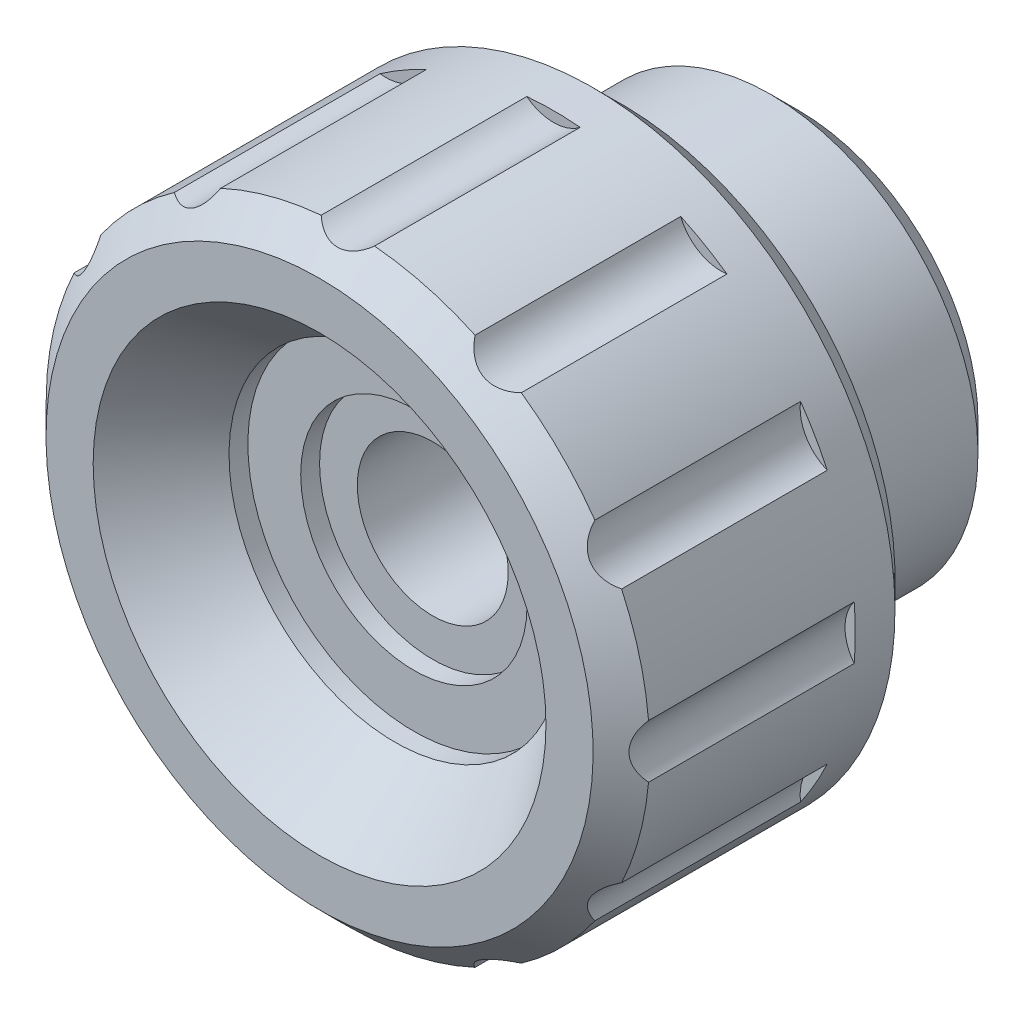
ISO-10303-21;
HEADER;
FILE_DESCRIPTION(('STEP AP214'),'2;1');
FILE_NAME('part.step','',(''),(''),'','','');
FILE_SCHEMA(('AUTOMOTIVE_DESIGN { 1 0 10303 214 1 1 1 1 }'));
ENDSEC;
DATA;
#1=APPLICATION_CONTEXT('core data for automotive mechanical design processes');
#2=APPLICATION_PROTOCOL_DEFINITION('international standard','automotive_design',2000,#1);
#3=PRODUCT_CONTEXT('',#1,'mechanical');
#4=PRODUCT('Part','Part','',(#3));
#5=PRODUCT_RELATED_PRODUCT_CATEGORY('part','',(#4));
#6=PRODUCT_DEFINITION_FORMATION('','',#4);
#7=PRODUCT_DEFINITION_CONTEXT('part definition',#1,'design');
#8=PRODUCT_DEFINITION('design','',#6,#7);
#9=PRODUCT_DEFINITION_SHAPE('','',#8);
#10=(LENGTH_UNIT() NAMED_UNIT(*) SI_UNIT(.MILLI.,.METRE.));
#11=(NAMED_UNIT(*) PLANE_ANGLE_UNIT() SI_UNIT($,.RADIAN.));
#12=(NAMED_UNIT(*) SI_UNIT($,.STERADIAN.) SOLID_ANGLE_UNIT());
#13=UNCERTAINTY_MEASURE_WITH_UNIT(LENGTH_MEASURE(1.E-05),#10,'distance_accuracy_value','');
#14=(GEOMETRIC_REPRESENTATION_CONTEXT(3) GLOBAL_UNCERTAINTY_ASSIGNED_CONTEXT((#13)) GLOBAL_UNIT_ASSIGNED_CONTEXT((#10,
#11,#12)) REPRESENTATION_CONTEXT('',''));
#15=CARTESIAN_POINT('',(0.,0.,0.));
#16=DIRECTION('',(0.,0.,1.));
#17=DIRECTION('',(1.,0.,0.));
#18=AXIS2_PLACEMENT_3D('',#15,#16,#17);
#19=CARTESIAN_POINT('',(3.49999999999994,0.,0.));
#20=DIRECTION('',(0.,0.,-1.));
#21=DIRECTION('',(0.,1.,0.));
#22=AXIS2_PLACEMENT_3D('',#19,#20,#21);
#23=PLANE('',#22);
#24=CARTESIAN_POINT('',(0.,0.,0.));
#25=DIRECTION('',(0.,0.,-1.));
#26=DIRECTION('',(-1.,0.,0.));
#27=AXIS2_PLACEMENT_3D('',#24,#25,#26);
#28=CIRCLE('',#27,2.4);
#29=CARTESIAN_POINT('',(-2.4,0.,0.));
#30=VERTEX_POINT('',#29);
#31=EDGE_CURVE('E22',#30,#30,#28,.F.);
#32=ORIENTED_EDGE('',*,*,#31,.T.);
#33=EDGE_LOOP('',(#32));
#34=FACE_BOUND('',#33,.T.);
#35=CARTESIAN_POINT('',(0.,0.,0.));
#36=DIRECTION('',(0.,0.,-1.));
#37=DIRECTION('',(0.,1.,0.));
#38=AXIS2_PLACEMENT_3D('',#35,#36,#37);
#39=CIRCLE('',#38,3.49999999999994);
#40=CARTESIAN_POINT('',(0.,3.49999999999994,0.));
#41=VERTEX_POINT('',#40);
#42=EDGE_CURVE('E354',#41,#41,#39,.T.);
#43=ORIENTED_EDGE('',*,*,#42,.T.);
#44=EDGE_LOOP('',(#43));
#45=FACE_BOUND('',#44,.T.);
#46=ADVANCED_FACE('F14',(#34,#45),#23,.T.);
#47=CARTESIAN_POINT('',(0.,0.,0.));
#48=DIRECTION('',(0.,0.,-1.));
#49=DIRECTION('',(0.,1.,0.));
#50=AXIS2_PLACEMENT_3D('',#47,#48,#49);
#51=CYLINDRICAL_SURFACE('',#50,3.49999999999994);
#52=CARTESIAN_POINT('',(0.,0.,0.300000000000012));
#53=DIRECTION('',(0.,0.,-1.));
#54=DIRECTION('',(0.,1.,0.));
#55=AXIS2_PLACEMENT_3D('',#52,#53,#54);
#56=CIRCLE('',#55,3.49999999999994);
#57=CARTESIAN_POINT('',(0.,3.49999999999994,0.300000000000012));
#58=VERTEX_POINT('',#57);
#59=EDGE_CURVE('E351',#58,#58,#56,.T.);
#60=ORIENTED_EDGE('',*,*,#59,.T.);
#61=EDGE_LOOP('',(#60));
#62=FACE_BOUND('',#61,.T.);
#63=ORIENTED_EDGE('',*,*,#42,.F.);
#64=EDGE_LOOP('',(#63));
#65=FACE_BOUND('',#64,.T.);
#66=ADVANCED_FACE('F406',(#62,#65),#51,.T.);
#67=CARTESIAN_POINT('',(4.74999999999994,0.,0.300000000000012));
#68=DIRECTION('',(0.,0.,-1.));
#69=DIRECTION('',(0.,1.,0.));
#70=AXIS2_PLACEMENT_3D('',#67,#68,#69);
#71=PLANE('',#70);
#72=CARTESIAN_POINT('',(0.,0.,0.300000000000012));
#73=DIRECTION('',(0.,0.,-1.));
#74=DIRECTION('',(0.,1.,0.));
#75=AXIS2_PLACEMENT_3D('',#72,#73,#74);
#76=CIRCLE('',#75,4.74999999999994);
#77=CARTESIAN_POINT('',(0.,4.74999999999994,0.300000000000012));
#78=VERTEX_POINT('',#77);
#79=EDGE_CURVE('E348',#78,#78,#76,.T.);
#80=ORIENTED_EDGE('',*,*,#79,.T.);
#81=EDGE_LOOP('',(#80));
#82=FACE_BOUND('',#81,.T.);
#83=ORIENTED_EDGE('',*,*,#59,.F.);
#84=EDGE_LOOP('',(#83));
#85=FACE_BOUND('',#84,.T.);
#86=ADVANCED_FACE('F413',(#82,#85),#71,.T.);
#87=CARTESIAN_POINT('',(0.,0.,0.300000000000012));
#88=DIRECTION('',(0.,0.,1.));
#89=DIRECTION('',(0.,-1.,0.));
#90=AXIS2_PLACEMENT_3D('',#87,#88,#89);
#91=CONICAL_SURFACE('',#90,4.74999999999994,0.785398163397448);
#92=CARTESIAN_POINT('',(0.,0.,1.05000000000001));
#93=DIRECTION('',(0.,0.,-1.));
#94=DIRECTION('',(0.,1.,0.));
#95=AXIS2_PLACEMENT_3D('',#92,#93,#94);
#96=CIRCLE('',#95,5.49999999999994);
#97=CARTESIAN_POINT('',(0.,5.49999999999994,1.05000000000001));
#98=VERTEX_POINT('',#97);
#99=EDGE_CURVE('E344',#98,#98,#96,.T.);
#100=ORIENTED_EDGE('',*,*,#99,.T.);
#101=EDGE_LOOP('',(#100));
#102=FACE_BOUND('',#101,.T.);
#103=ORIENTED_EDGE('',*,*,#79,.F.);
#104=EDGE_LOOP('',(#103));
#105=FACE_BOUND('',#104,.T.);
#106=ADVANCED_FACE('F837',(#102,#105),#91,.T.);
#107=CARTESIAN_POINT('',(0.,0.,0.));
#108=DIRECTION('',(0.,0.,-1.));
#109=DIRECTION('',(0.,1.,0.));
#110=AXIS2_PLACEMENT_3D('',#107,#108,#109);
#111=CYLINDRICAL_SURFACE('',#110,5.49999999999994);
#112=CARTESIAN_POINT('',(0.,0.,5.));
#113=DIRECTION('',(0.,0.,-1.));
#114=DIRECTION('',(-1.,0.,0.));
#115=AXIS2_PLACEMENT_3D('',#112,#113,#114);
#116=CIRCLE('',#115,5.49999999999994);
#117=CARTESIAN_POINT('',(-5.49999999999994,0.,5.));
#118=VERTEX_POINT('',#117);
#119=EDGE_CURVE('E211',#118,#118,#116,.F.);
#120=ORIENTED_EDGE('',*,*,#119,.F.);
#121=EDGE_LOOP('',(#120));
#122=FACE_BOUND('',#121,.T.);
#123=ORIENTED_EDGE('',*,*,#99,.F.);
#124=EDGE_LOOP('',(#123));
#125=FACE_BOUND('',#124,.T.);
#126=ADVANCED_FACE('F433',(#122,#125),#111,.T.);
#127=CARTESIAN_POINT('',(0.,8.,5.));
#128=DIRECTION('',(0.,0.,-1.));
#129=DIRECTION('',(-1.,0.,0.));
#130=AXIS2_PLACEMENT_3D('',#127,#128,#129);
#131=PLANE('',#130);
#132=CARTESIAN_POINT('',(0.,0.,5.));
#133=DIRECTION('',(0.,0.,-1.));
#134=DIRECTION('',(-1.,0.,0.));
#135=AXIS2_PLACEMENT_3D('',#132,#133,#134);
#136=CIRCLE('',#135,7.25);
#137=CARTESIAN_POINT('',(-7.25,0.,5.));
#138=VERTEX_POINT('',#137);
#139=EDGE_CURVE('E216',#138,#138,#136,.T.);
#140=ORIENTED_EDGE('',*,*,#139,.T.);
#141=EDGE_LOOP('',(#140));
#142=FACE_BOUND('',#141,.T.);
#143=ORIENTED_EDGE('',*,*,#119,.T.);
#144=EDGE_LOOP('',(#143));
#145=FACE_BOUND('',#144,.T.);
#146=ADVANCED_FACE('F430',(#142,#145),#131,.T.);
#147=CARTESIAN_POINT('',(4.4,0.,10.5000000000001));
#148=DIRECTION('',(0.,0.,1.));
#149=DIRECTION('',(0.,-1.,0.));
#150=AXIS2_PLACEMENT_3D('',#147,#148,#149);
#151=PLANE('',#150);
#152=CARTESIAN_POINT('',(0.,0.,10.5000000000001));
#153=DIRECTION('',(0.,0.,1.));
#154=DIRECTION('',(1.,0.,0.));
#155=AXIS2_PLACEMENT_3D('',#152,#153,#154);
#156=CIRCLE('',#155,3.);
#157=CARTESIAN_POINT('',(3.,0.,10.5000000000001));
#158=VERTEX_POINT('',#157);
#159=EDGE_CURVE('E905',#158,#158,#156,.T.);
#160=ORIENTED_EDGE('',*,*,#159,.F.);
#161=EDGE_LOOP('',(#160));
#162=FACE_BOUND('',#161,.T.);
#163=CARTESIAN_POINT('',(0.,0.,10.5000000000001));
#164=DIRECTION('',(0.,0.,-1.));
#165=DIRECTION('',(0.,1.,0.));
#166=AXIS2_PLACEMENT_3D('',#163,#164,#165);
#167=CIRCLE('',#166,4.4);
#168=CARTESIAN_POINT('',(0.,4.4,10.5000000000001));
#169=VERTEX_POINT('',#168);
#170=EDGE_CURVE('E288',#169,#169,#167,.T.);
#171=ORIENTED_EDGE('',*,*,#170,.F.);
#172=EDGE_LOOP('',(#171));
#173=FACE_BOUND('',#172,.T.);
#174=ADVANCED_FACE('F394',(#162,#173),#151,.T.);
#175=CARTESIAN_POINT('',(0.,0.,0.));
#176=DIRECTION('',(0.,0.,-1.));
#177=DIRECTION('',(0.,1.,0.));
#178=AXIS2_PLACEMENT_3D('',#175,#176,#177);
#179=CYLINDRICAL_SURFACE('',#178,4.4);
#180=ORIENTED_EDGE('',*,*,#170,.T.);
#181=EDGE_LOOP('',(#180));
#182=FACE_BOUND('',#181,.T.);
#183=CARTESIAN_POINT('',(0.,0.,11.));
#184=DIRECTION('',(0.,0.,-1.));
#185=DIRECTION('',(0.,1.,0.));
#186=AXIS2_PLACEMENT_3D('',#183,#184,#185);
#187=CIRCLE('',#186,4.4);
#188=CARTESIAN_POINT('',(0.,4.4,11.));
#189=VERTEX_POINT('',#188);
#190=EDGE_CURVE('E332',#189,#189,#187,.T.);
#191=ORIENTED_EDGE('',*,*,#190,.F.);
#192=EDGE_LOOP('',(#191));
#193=FACE_BOUND('',#192,.T.);
#194=ADVANCED_FACE('F390',(#182,#193),#179,.F.);
#195=CARTESIAN_POINT('',(0.,0.,13.));
#196=DIRECTION('',(0.,0.,1.));
#197=DIRECTION('',(0.,-1.,0.));
#198=AXIS2_PLACEMENT_3D('',#195,#196,#197);
#199=CONICAL_SURFACE('',#198,6.,0.67474094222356);
#200=ORIENTED_EDGE('',*,*,#190,.T.);
#201=EDGE_LOOP('',(#200));
#202=FACE_BOUND('',#201,.T.);
#203=CARTESIAN_POINT('',(0.,0.,13.));
#204=DIRECTION('',(0.,0.,-1.));
#205=DIRECTION('',(0.,1.,0.));
#206=AXIS2_PLACEMENT_3D('',#203,#204,#205);
#207=CIRCLE('',#206,6.);
#208=CARTESIAN_POINT('',(0.,6.,13.));
#209=VERTEX_POINT('',#208);
#210=EDGE_CURVE('E335',#209,#209,#207,.T.);
#211=ORIENTED_EDGE('',*,*,#210,.F.);
#212=EDGE_LOOP('',(#211));
#213=FACE_BOUND('',#212,.T.);
#214=ADVANCED_FACE('F393',(#202,#213),#199,.F.);
#215=CARTESIAN_POINT('',(6.,0.,13.));
#216=DIRECTION('',(0.,0.,1.));
#217=DIRECTION('',(0.,-1.,0.));
#218=AXIS2_PLACEMENT_3D('',#215,#216,#217);
#219=PLANE('',#218);
#220=ORIENTED_EDGE('',*,*,#210,.T.);
#221=EDGE_LOOP('',(#220));
#222=FACE_BOUND('',#221,.T.);
#223=CARTESIAN_POINT('',(0.,0.,13.));
#224=DIRECTION('',(0.,0.,-1.));
#225=DIRECTION('',(0.,1.,0.));
#226=AXIS2_PLACEMENT_3D('',#223,#224,#225);
#227=CIRCLE('',#226,7.25);
#228=CARTESIAN_POINT('',(0.,7.25,13.));
#229=VERTEX_POINT('',#228);
#230=EDGE_CURVE('E338',#229,#229,#227,.T.);
#231=ORIENTED_EDGE('',*,*,#230,.F.);
#232=EDGE_LOOP('',(#231));
#233=FACE_BOUND('',#232,.T.);
#234=ADVANCED_FACE('F386',(#222,#233),#219,.T.);
#235=CARTESIAN_POINT('',(0.,0.,6.8));
#236=DIRECTION('',(0.,0.,1.));
#237=DIRECTION('',(0.,-1.,0.));
#238=AXIS2_PLACEMENT_3D('',#235,#236,#237);
#239=PLANE('',#238);
#240=CARTESIAN_POINT('',(-1.2490009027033E-13,-8.87500000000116,6.8));
#241=DIRECTION('',(0.,0.,-1.));
#242=DIRECTION('',(0.,-1.,0.));
#243=AXIS2_PLACEMENT_3D('',#240,#241,#242);
#244=CIRCLE('',#243,1.15);
#245=CARTESIAN_POINT('',(-0.707804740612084,-7.96862676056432,6.8));
#246=VERTEX_POINT('',#245);
#247=CARTESIAN_POINT('',(0.70780474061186,-7.96862676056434,6.8));
#248=VERTEX_POINT('',#247);
#249=EDGE_CURVE('E275',#246,#248,#244,.T.);
#250=ORIENTED_EDGE('',*,*,#249,.F.);
#251=CARTESIAN_POINT('',(0.,0.,6.8));
#252=DIRECTION('',(0.,0.,1.));
#253=DIRECTION('',(0.,-1.,0.));
#254=AXIS2_PLACEMENT_3D('',#251,#252,#253);
#255=CIRCLE('',#254,8.);
#256=EDGE_CURVE('E222',#248,#246,#255,.F.);
#257=ORIENTED_EDGE('',*,*,#256,.F.);
#258=EDGE_LOOP('',(#250,#257));
#259=FACE_BOUND('',#258,.T.);
#260=ADVANCED_FACE('F382',(#259),#239,.T.);
#261=CARTESIAN_POINT('',(-1.2490009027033E-13,-8.87500000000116,6.8));
#262=DIRECTION('',(0.,0.,1.));
#263=DIRECTION('',(0.,-1.,0.));
#264=AXIS2_PLACEMENT_3D('',#261,#262,#263);
#265=CYLINDRICAL_SURFACE('',#264,1.15);
#266=DIRECTION('',(0.,0.,1.));
#267=VECTOR('',#266,1.);
#268=CARTESIAN_POINT('',(-0.707804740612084,-7.96862676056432,6.8));
#269=LINE('',#268,#267);
#270=CARTESIAN_POINT('',(-0.707804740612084,-7.96862676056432,12.2499999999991));
#271=VERTEX_POINT('',#270);
#272=EDGE_CURVE('E301',#246,#271,#269,.T.);
#273=ORIENTED_EDGE('',*,*,#272,.F.);
#274=ORIENTED_EDGE('',*,*,#249,.T.);
#275=DIRECTION('',(0.,0.,1.));
#276=VECTOR('',#275,1.);
#277=CARTESIAN_POINT('',(0.70780474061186,-7.96862676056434,6.8));
#278=LINE('',#277,#276);
#279=CARTESIAN_POINT('',(0.707804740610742,-7.96862676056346,12.25));
#280=VERTEX_POINT('',#279);
#281=EDGE_CURVE('E299',#248,#280,#278,.T.);
#282=ORIENTED_EDGE('',*,*,#281,.T.);
#283=CARTESIAN_POINT('',(-0.708004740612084,-7.96878298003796,12.2498266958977));
#284=CARTESIAN_POINT('',(-0.670016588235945,-7.93910304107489,12.2827435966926));
#285=CARTESIAN_POINT('',(-0.629096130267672,-7.91098728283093,12.3141461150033));
#286=CARTESIAN_POINT('',(-0.541113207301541,-7.85895957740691,12.3725489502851));
#287=CARTESIAN_POINT('',(-0.493993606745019,-7.83509230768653,12.3995022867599));
#288=CARTESIAN_POINT('',(-0.403110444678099,-7.79705455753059,12.4426329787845));
#289=CARTESIAN_POINT('',(-0.360275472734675,-7.7819114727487,12.4598771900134));
#290=CARTESIAN_POINT('',(-0.271519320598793,-7.75656520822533,12.4888070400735));
#291=CARTESIAN_POINT('',(-0.225610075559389,-7.74634405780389,12.5005128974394));
#292=CARTESIAN_POINT('',(-0.131281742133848,-7.73151414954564,12.5175147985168));
#293=CARTESIAN_POINT('',(-0.0828445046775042,-7.72695427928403,12.522755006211));
#294=CARTESIAN_POINT('',(0.014487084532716,-7.72406175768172,12.5260777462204));
#295=CARTESIAN_POINT('',(0.0633815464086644,-7.72573064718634,12.5241585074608));
#296=CARTESIAN_POINT('',(0.154026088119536,-7.73456075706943,12.5140225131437));
#297=CARTESIAN_POINT('',(0.195934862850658,-7.74104594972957,12.5065809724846));
#298=CARTESIAN_POINT('',(0.277692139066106,-7.7582480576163,12.4868901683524));
#299=CARTESIAN_POINT('',(0.31753961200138,-7.76896706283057,12.4746385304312));
#300=CARTESIAN_POINT('',(0.408286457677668,-7.79851491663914,12.440973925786));
#301=CARTESIAN_POINT('',(0.458050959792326,-7.8188729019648,12.4178517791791));
#302=CARTESIAN_POINT('',(0.551931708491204,-7.86474498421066,12.3660439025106));
#303=CARTESIAN_POINT('',(0.596041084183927,-7.89026525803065,12.3373515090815));
#304=CARTESIAN_POINT('',(0.661880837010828,-7.93410696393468,12.2883657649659));
#305=CARTESIAN_POINT('',(0.685443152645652,-7.95116148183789,12.2693731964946));
#306=CARTESIAN_POINT('',(0.708004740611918,-7.96878298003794,12.2498266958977));
#307=B_SPLINE_CURVE_WITH_KNOTS('',3,(#283,#284,#285,#286,#287,#288,#289,#290,#291,#292,#293,
#294,#295,#296,#297,#298,#299,#300,#301,#302,#303,#304,#305,#306),.UNSPECIFIED.,.F.,.F.,(4,2,2,
2,2,2,2,2,2,2,2,4),(0.,0.17542065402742,0.352589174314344,0.497789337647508,0.642455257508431,
0.78836193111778,0.934304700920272,1.06290984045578,1.19157854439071,1.36619586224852,
1.54102336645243,1.64509140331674),.UNSPECIFIED.);
#308=EDGE_CURVE('E462',#271,#280,#307,.T.);
#309=ORIENTED_EDGE('',*,*,#308,.F.);
#310=EDGE_LOOP('',(#273,#274,#282,#309));
#311=FACE_BOUND('',#310,.T.);
#312=ADVANCED_FACE('F385',(#311),#265,.F.);
#313=CARTESIAN_POINT('',(4.43750000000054,-7.68597545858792,6.8));
#314=DIRECTION('',(0.,0.,-1.));
#315=DIRECTION('',(0.,-1.,0.));
#316=AXIS2_PLACEMENT_3D('',#313,#314,#315);
#317=CIRCLE('',#316,1.15);
#318=CARTESIAN_POINT('',(3.37133649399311,-7.25493557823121,6.8));
#319=VERTEX_POINT('',#318);
#320=CARTESIAN_POINT('',(4.59729026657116,-6.54713083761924,6.8));
#321=VERTEX_POINT('',#320);
#322=EDGE_CURVE('E278',#319,#321,#317,.T.);
#323=ORIENTED_EDGE('',*,*,#322,.F.);
#324=EDGE_CURVE('E218',#321,#319,#255,.F.);
#325=ORIENTED_EDGE('',*,*,#324,.F.);
#326=EDGE_LOOP('',(#323,#325));
#327=FACE_BOUND('',#326,.T.);
#328=ADVANCED_FACE('F389',(#327),#239,.T.);
#329=CARTESIAN_POINT('',(4.43750000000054,-7.68597545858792,6.8));
#330=DIRECTION('',(0.,0.,1.));
#331=DIRECTION('',(0.,-1.,0.));
#332=AXIS2_PLACEMENT_3D('',#329,#330,#331);
#333=CYLINDRICAL_SURFACE('',#332,1.15);
#334=DIRECTION('',(0.,0.,1.));
#335=VECTOR('',#334,1.);
#336=CARTESIAN_POINT('',(3.37133649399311,-7.25493557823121,6.8));
#337=LINE('',#336,#335);
#338=CARTESIAN_POINT('',(3.37133649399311,-7.25493557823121,12.2499999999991));
#339=VERTEX_POINT('',#338);
#340=EDGE_CURVE('E297',#319,#339,#337,.T.);
#341=ORIENTED_EDGE('',*,*,#340,.F.);
#342=ORIENTED_EDGE('',*,*,#322,.T.);
#343=DIRECTION('',(0.,0.,1.));
#344=VECTOR('',#343,1.);
#345=CARTESIAN_POINT('',(4.59729026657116,-6.54713083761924,6.8));
#346=LINE('',#345,#344);
#347=CARTESIAN_POINT('',(4.59729026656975,-6.54713083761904,12.25));
#348=VERTEX_POINT('',#347);
#349=EDGE_CURVE('E295',#321,#348,#346,.T.);
#350=ORIENTED_EDGE('',*,*,#349,.T.);
#351=CARTESIAN_POINT('',(3.37125565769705,-7.25513557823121,12.2498526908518));
#352=CARTESIAN_POINT('',(3.38931533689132,-7.2104398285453,12.2827673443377));
#353=CARTESIAN_POINT('',(3.41069638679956,-7.16563264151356,12.3141675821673));
#354=CARTESIAN_POINT('',(3.46087905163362,-7.07658806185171,12.3725658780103));
#355=CARTESIAN_POINT('',(3.48975247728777,-7.032360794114,12.399516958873));
#356=CARTESIAN_POINT('',(3.54944136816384,-6.95398075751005,12.4426442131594));
#357=CARTESIAN_POINT('',(3.57896658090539,-6.91945000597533,12.459887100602));
#358=CARTESIAN_POINT('',(3.64315945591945,-6.85312362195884,12.4888142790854));
#359=CARTESIAN_POINT('',(3.67780779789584,-6.82131839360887,12.5005187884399));
#360=CARTESIAN_POINT('',(3.75208390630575,-6.76131362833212,12.5175180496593));
#361=CARTESIAN_POINT('',(3.79175182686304,-6.73314735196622,12.5227569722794));
#362=CARTESIAN_POINT('',(3.87459677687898,-6.68197914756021,12.5260773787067));
#363=CARTESIAN_POINT('',(3.91777467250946,-6.65897849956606,12.5241570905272));
#364=CARTESIAN_POINT('',(4.00068974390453,-6.62130533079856,12.5140193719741));
#365=CARTESIAN_POINT('',(4.04022639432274,-6.60596809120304,12.5065770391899));
#366=CARTESIAN_POINT('',(4.1196311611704,-6.57998847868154,12.4868847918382));
#367=CARTESIAN_POINT('',(4.15949943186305,-6.56934843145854,12.4746325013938));
#368=CARTESIAN_POINT('',(4.25286326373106,-6.54956561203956,12.4409660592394));
#369=CARTESIAN_POINT('',(4.30614049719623,-6.54231471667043,12.4178426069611));
#370=CARTESIAN_POINT('',(4.41038121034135,-6.53510255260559,12.3660321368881));
#371=CARTESIAN_POINT('',(4.46134183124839,-6.53515005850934,12.3373384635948));
#372=CARTESIAN_POINT('',(4.54025639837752,-6.54019818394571,12.2883669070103));
#373=CARTESIAN_POINT('',(4.56916440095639,-6.54318368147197,12.269391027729));
#374=CARTESIAN_POINT('',(4.59749026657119,-6.5471589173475,12.2498620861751));
#375=B_SPLINE_CURVE_WITH_KNOTS('',3,(#351,#352,#353,#354,#355,#356,#357,#358,#359,#360,#361,
#362,#363,#364,#365,#366,#367,#368,#369,#370,#371,#372,#373,#374),.UNSPECIFIED.,.F.,.F.,(4,2,2,
2,2,2,2,2,2,2,2,4),(0.,0.175413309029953,0.352574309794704,0.497771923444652,0.64243531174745,
0.788339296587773,0.934279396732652,1.06288407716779,1.19155236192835,1.36617341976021,
1.54100441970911,1.64498267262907),.UNSPECIFIED.);
#376=EDGE_CURVE('E455',#339,#348,#375,.T.);
#377=ORIENTED_EDGE('',*,*,#376,.F.);
#378=EDGE_LOOP('',(#341,#342,#350,#377));
#379=FACE_BOUND('',#378,.T.);
#380=ADVANCED_FACE('F469',(#379),#333,.F.);
#381=CARTESIAN_POINT('',(7.68597545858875,-4.43749999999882,6.8));
#382=DIRECTION('',(0.,0.,-1.));
#383=DIRECTION('',(0.,-1.,0.));
#384=AXIS2_PLACEMENT_3D('',#381,#382,#383);
#385=CIRCLE('',#384,1.15000000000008);
#386=CARTESIAN_POINT('',(6.54713083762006,-4.59729026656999,6.8));
#387=VERTEX_POINT('',#386);
#388=CARTESIAN_POINT('',(7.25493557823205,-3.37133649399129,6.8));
#389=VERTEX_POINT('',#388);
#390=EDGE_CURVE('E281',#387,#389,#385,.T.);
#391=ORIENTED_EDGE('',*,*,#390,.F.);
#392=EDGE_CURVE('E212',#389,#387,#255,.F.);
#393=ORIENTED_EDGE('',*,*,#392,.F.);
#394=EDGE_LOOP('',(#391,#393));
#395=FACE_BOUND('',#394,.T.);
#396=ADVANCED_FACE('F472',(#395),#239,.T.);
#397=CARTESIAN_POINT('',(7.68597545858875,-4.43749999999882,6.8));
#398=DIRECTION('',(0.,0.,1.));
#399=DIRECTION('',(0.,-1.,0.));
#400=AXIS2_PLACEMENT_3D('',#397,#398,#399);
#401=CYLINDRICAL_SURFACE('',#400,1.15000000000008);
#402=DIRECTION('',(0.,0.,1.));
#403=VECTOR('',#402,1.);
#404=CARTESIAN_POINT('',(6.54713083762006,-4.59729026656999,6.8));
#405=LINE('',#404,#403);
#406=CARTESIAN_POINT('',(6.54713083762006,-4.59729026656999,12.2499999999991));
#407=VERTEX_POINT('',#406);
#408=EDGE_CURVE('E293',#387,#407,#405,.T.);
#409=ORIENTED_EDGE('',*,*,#408,.F.);
#410=ORIENTED_EDGE('',*,*,#390,.T.);
#411=DIRECTION('',(0.,0.,1.));
#412=VECTOR('',#411,1.);
#413=CARTESIAN_POINT('',(7.25493557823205,-3.37133649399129,6.8));
#414=LINE('',#413,#412);
#415=CARTESIAN_POINT('',(7.25493557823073,-3.37133649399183,12.25));
#416=VERTEX_POINT('',#415);
#417=EDGE_CURVE('E291',#389,#416,#414,.T.);
#418=ORIENTED_EDGE('',*,*,#417,.T.);
#419=CARTESIAN_POINT('',(6.54715891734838,-4.59749026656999,12.249862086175));
#420=CARTESIAN_POINT('',(6.54045182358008,-4.54975319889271,12.2827759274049));
#421=CARTESIAN_POINT('',(6.53656536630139,-4.50025899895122,12.3141753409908));
#422=CARTESIAN_POINT('',(6.53550363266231,-4.39805391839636,12.3725719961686));
#423=CARTESIAN_POINT('',(6.53839560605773,-4.34531590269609,12.3995222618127));
#424=CARTESIAN_POINT('',(6.55089846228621,-4.24759324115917,12.4426482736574));
#425=CARTESIAN_POINT('',(6.55920303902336,-4.20292634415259,12.4598906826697));
#426=CARTESIAN_POINT('',(6.58163319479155,-4.11339009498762,12.4888168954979));
#427=CARTESIAN_POINT('',(6.59573724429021,-4.06852209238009,12.5005209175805));
#428=CARTESIAN_POINT('',(6.63006040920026,-3.97941910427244,12.5175192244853));
#429=CARTESIAN_POINT('',(6.65033092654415,-3.93519284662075,12.5227576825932));
#430=CARTESIAN_POINT('',(6.69649299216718,-3.84945829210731,12.5260772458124));
#431=CARTESIAN_POINT('',(6.72238593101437,-3.8079506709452,12.5241565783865));
#432=CARTESIAN_POINT('',(6.77535612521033,-3.73386792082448,12.5140182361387));
#433=CARTESIAN_POINT('',(6.80192739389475,-3.70081740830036,12.5065756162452));
#434=CARTESIAN_POINT('',(6.85770436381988,-3.63861654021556,12.486882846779));
#435=CARTESIAN_POINT('',(6.88691136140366,-3.60946812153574,12.4746303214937));
#436=CARTESIAN_POINT('',(6.95787590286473,-3.54565408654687,12.4409632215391));
#437=CARTESIAN_POINT('',(7.00039031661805,-3.51273611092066,12.4178393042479));
#438=CARTESIAN_POINT('',(7.08706015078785,-3.45437012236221,12.3660279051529));
#439=CARTESIAN_POINT('',(7.13121748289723,-3.42893113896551,12.3373337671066));
#440=CARTESIAN_POINT('',(7.20208570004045,-3.39384524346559,12.2883604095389));
#441=CARTESIAN_POINT('',(7.22861528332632,-3.38197627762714,12.2693831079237));
#442=CARTESIAN_POINT('',(7.25513557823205,-3.37125565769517,12.2498526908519));
#443=B_SPLINE_CURVE_WITH_KNOTS('',3,(#419,#420,#421,#422,#423,#424,#425,#426,#427,#428,#429,
#430,#431,#432,#433,#434,#435,#436,#437,#438,#439,#440,#441,#442),.UNSPECIFIED.,.F.,.F.,(4,2,2,
2,2,2,2,2,2,2,2,4),(0.,0.175410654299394,0.352568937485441,0.497765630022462,0.642428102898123,
0.788331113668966,0.934270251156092,1.06287477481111,1.19154289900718,1.36616525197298,
1.54099757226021,1.64498268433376),.UNSPECIFIED.);
#444=EDGE_CURVE('E207',#407,#416,#443,.T.);
#445=ORIENTED_EDGE('',*,*,#444,.F.);
#446=EDGE_LOOP('',(#409,#410,#418,#445));
#447=FACE_BOUND('',#446,.T.);
#448=ADVANCED_FACE('F441',(#447),#401,.F.);
#449=CARTESIAN_POINT('',(8.87500000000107,1.83793952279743E-12,6.8));
#450=DIRECTION('',(0.,0.,-1.));
#451=DIRECTION('',(0.,-1.,0.));
#452=AXIS2_PLACEMENT_3D('',#449,#450,#451);
#453=CIRCLE('',#452,1.15);
#454=CARTESIAN_POINT('',(7.96862676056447,-0.707804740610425,6.8));
#455=VERTEX_POINT('',#454);
#456=CARTESIAN_POINT('',(7.96862676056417,0.707804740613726,6.8));
#457=VERTEX_POINT('',#456);
#458=EDGE_CURVE('E189',#455,#457,#453,.T.);
#459=ORIENTED_EDGE('',*,*,#458,.F.);
#460=EDGE_CURVE('E203',#457,#455,#255,.F.);
#461=ORIENTED_EDGE('',*,*,#460,.F.);
#462=EDGE_LOOP('',(#459,#461));
#463=FACE_BOUND('',#462,.T.);
#464=ADVANCED_FACE('F439',(#463),#239,.T.);
#465=CARTESIAN_POINT('',(8.87500000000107,1.83793952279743E-12,6.8));
#466=DIRECTION('',(0.,0.,1.));
#467=DIRECTION('',(0.,-1.,0.));
#468=AXIS2_PLACEMENT_3D('',#465,#466,#467);
#469=CYLINDRICAL_SURFACE('',#468,1.15);
#470=DIRECTION('',(0.,0.,1.));
#471=VECTOR('',#470,1.);
#472=CARTESIAN_POINT('',(7.96862676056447,-0.707804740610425,6.8));
#473=LINE('',#472,#471);
#474=CARTESIAN_POINT('',(7.96862676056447,-0.707804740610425,12.2499999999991));
#475=VERTEX_POINT('',#474);
#476=EDGE_CURVE('E289',#455,#475,#473,.T.);
#477=ORIENTED_EDGE('',*,*,#476,.F.);
#478=ORIENTED_EDGE('',*,*,#458,.T.);
#479=DIRECTION('',(0.,0.,1.));
#480=VECTOR('',#479,1.);
#481=CARTESIAN_POINT('',(7.96862676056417,0.707804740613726,6.8));
#482=LINE('',#481,#480);
#483=CARTESIAN_POINT('',(7.9686267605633,0.707804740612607,12.25));
#484=VERTEX_POINT('',#483);
#485=EDGE_CURVE('E286',#457,#484,#482,.T.);
#486=ORIENTED_EDGE('',*,*,#485,.T.);
#487=CARTESIAN_POINT('',(7.9687829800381,-0.708004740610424,12.2498266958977));
#488=CARTESIAN_POINT('',(7.93910304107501,-0.670016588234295,12.2827435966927));
#489=CARTESIAN_POINT('',(7.91098728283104,-0.629096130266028,12.3141461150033));
#490=CARTESIAN_POINT('',(7.85895957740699,-0.541113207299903,12.3725489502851));
#491=CARTESIAN_POINT('',(7.83509230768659,-0.49399360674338,12.3995022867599));
#492=CARTESIAN_POINT('',(7.79705455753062,-0.403110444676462,12.4426329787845));
#493=CARTESIAN_POINT('',(7.78191147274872,-0.36027547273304,12.4598771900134));
#494=CARTESIAN_POINT('',(7.75656520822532,-0.271519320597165,12.4888070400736));
#495=CARTESIAN_POINT('',(7.74634405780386,-0.225610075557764,12.5005128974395));
#496=CARTESIAN_POINT('',(7.73151414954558,-0.131281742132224,12.5175147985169));
#497=CARTESIAN_POINT('',(7.72695427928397,-0.0828445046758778,12.5227550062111));
#498=CARTESIAN_POINT('',(7.72406175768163,0.0144870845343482,12.5260777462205));
#499=CARTESIAN_POINT('',(7.72573064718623,0.0633815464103,12.5241585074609));
#500=CARTESIAN_POINT('',(7.7345607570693,0.154026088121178,12.5140225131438));
#501=CARTESIAN_POINT('',(7.74104594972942,0.195934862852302,12.5065809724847));
#502=CARTESIAN_POINT('',(7.75824805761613,0.277692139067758,12.4868901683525));
#503=CARTESIAN_POINT('',(7.76896706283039,0.317539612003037,12.4746385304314));
#504=CARTESIAN_POINT('',(7.79851491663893,0.408286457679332,12.4409739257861));
#505=CARTESIAN_POINT('',(7.81887290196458,0.458050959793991,12.4178517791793));
#506=CARTESIAN_POINT('',(7.86474498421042,0.551931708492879,12.3660439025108));
#507=CARTESIAN_POINT('',(7.89026525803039,0.596041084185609,12.3373515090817));
#508=CARTESIAN_POINT('',(7.93410696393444,0.661880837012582,12.288365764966));
#509=CARTESIAN_POINT('',(7.95116148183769,0.685443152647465,12.2693731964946));
#510=CARTESIAN_POINT('',(7.96878298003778,0.708004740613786,12.2498266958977));
#511=B_SPLINE_CURVE_WITH_KNOTS('',3,(#487,#488,#489,#490,#491,#492,#493,#494,#495,#496,#497,
#498,#499,#500,#501,#502,#503,#504,#505,#506,#507,#508,#509,#510),.UNSPECIFIED.,.F.,.F.,(4,2,2,
2,2,2,2,2,2,2,2,4),(0.,0.175420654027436,0.352589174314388,0.497789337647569,0.642455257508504,
0.788361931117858,0.934304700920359,1.06290984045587,1.19157854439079,1.36619586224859,
1.5410233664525,1.64509140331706),.UNSPECIFIED.);
#512=EDGE_CURVE('E201',#475,#484,#511,.T.);
#513=ORIENTED_EDGE('',*,*,#512,.F.);
#514=EDGE_LOOP('',(#477,#478,#486,#513));
#515=FACE_BOUND('',#514,.T.);
#516=ADVANCED_FACE('F435',(#515),#469,.F.);
#517=CARTESIAN_POINT('',(7.68597545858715,4.43750000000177,6.8));
#518=DIRECTION('',(0.,0.,-1.));
#519=DIRECTION('',(0.,-1.,0.));
#520=AXIS2_PLACEMENT_3D('',#517,#518,#519);
#521=CIRCLE('',#520,1.15);
#522=CARTESIAN_POINT('',(7.25493557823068,3.37133649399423,6.8));
#523=VERTEX_POINT('',#522);
#524=CARTESIAN_POINT('',(6.54713083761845,4.59729026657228,6.8));
#525=VERTEX_POINT('',#524);
#526=EDGE_CURVE('E180',#523,#525,#521,.T.);
#527=ORIENTED_EDGE('',*,*,#526,.F.);
#528=EDGE_CURVE('E193',#525,#523,#255,.F.);
#529=ORIENTED_EDGE('',*,*,#528,.F.);
#530=EDGE_LOOP('',(#527,#529));
#531=FACE_BOUND('',#530,.T.);
#532=ADVANCED_FACE('F192',(#531),#239,.T.);
#533=CARTESIAN_POINT('',(7.68597545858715,4.43750000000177,6.8));
#534=DIRECTION('',(0.,0.,1.));
#535=DIRECTION('',(0.,-1.,0.));
#536=AXIS2_PLACEMENT_3D('',#533,#534,#535);
#537=CYLINDRICAL_SURFACE('',#536,1.15);
#538=DIRECTION('',(0.,0.,1.));
#539=VECTOR('',#538,1.);
#540=CARTESIAN_POINT('',(7.25493557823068,3.37133649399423,6.8));
#541=LINE('',#540,#539);
#542=CARTESIAN_POINT('',(7.25493557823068,3.37133649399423,12.2499999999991));
#543=VERTEX_POINT('',#542);
#544=EDGE_CURVE('E177',#523,#543,#541,.T.);
#545=ORIENTED_EDGE('',*,*,#544,.F.);
#546=ORIENTED_EDGE('',*,*,#526,.T.);
#547=DIRECTION('',(0.,0.,1.));
#548=VECTOR('',#547,1.);
#549=CARTESIAN_POINT('',(6.54713083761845,4.59729026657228,6.8));
#550=LINE('',#549,#548);
#551=CARTESIAN_POINT('',(6.54713083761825,4.59729026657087,12.25));
#552=VERTEX_POINT('',#551);
#553=EDGE_CURVE('E188',#525,#552,#550,.T.);
#554=ORIENTED_EDGE('',*,*,#553,.T.);
#555=CARTESIAN_POINT('',(7.25513557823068,3.37125565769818,12.2498526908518));
#556=CARTESIAN_POINT('',(7.21043982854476,3.38931533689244,12.2827673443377));
#557=CARTESIAN_POINT('',(7.16563264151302,3.41069638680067,12.3141675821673));
#558=CARTESIAN_POINT('',(7.07658806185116,3.46087905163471,12.3725658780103));
#559=CARTESIAN_POINT('',(7.03236079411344,3.48975247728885,12.399516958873));
#560=CARTESIAN_POINT('',(6.95398075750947,3.5494413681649,12.4426442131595));
#561=CARTESIAN_POINT('',(6.91945000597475,3.57896658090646,12.459887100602));
#562=CARTESIAN_POINT('',(6.85312362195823,3.6431594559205,12.4888142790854));
#563=CARTESIAN_POINT('',(6.82131839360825,3.67780779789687,12.50051878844));
#564=CARTESIAN_POINT('',(6.76131362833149,3.75208390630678,12.5175180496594));
#565=CARTESIAN_POINT('',(6.73314735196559,3.79175182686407,12.5227569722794));
#566=CARTESIAN_POINT('',(6.68197914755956,3.87459677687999,12.5260773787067));
#567=CARTESIAN_POINT('',(6.6589784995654,3.91777467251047,12.5241570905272));
#568=CARTESIAN_POINT('',(6.62130533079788,4.00068974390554,12.5140193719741));
#569=CARTESIAN_POINT('',(6.60596809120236,4.04022639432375,12.50657703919));
#570=CARTESIAN_POINT('',(6.57998847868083,4.1196311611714,12.4868847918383));
#571=CARTESIAN_POINT('',(6.56934843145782,4.15949943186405,12.4746325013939));
#572=CARTESIAN_POINT('',(6.54956561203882,4.25286326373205,12.4409660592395));
#573=CARTESIAN_POINT('',(6.54231471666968,4.30614049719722,12.4178426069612));
#574=CARTESIAN_POINT('',(6.53510255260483,4.41038121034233,12.3660321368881));
#575=CARTESIAN_POINT('',(6.53515005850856,4.46134183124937,12.3373384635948));
#576=CARTESIAN_POINT('',(6.54019818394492,4.54025639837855,12.2883669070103));
#577=CARTESIAN_POINT('',(6.54318368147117,4.56916440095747,12.269391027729));
#578=CARTESIAN_POINT('',(6.54715891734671,4.59749026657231,12.2498620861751));
#579=B_SPLINE_CURVE_WITH_KNOTS('',3,(#555,#556,#557,#558,#559,#560,#561,#562,#563,#564,#565,
#566,#567,#568,#569,#570,#571,#572,#573,#574,#575,#576,#577,#578),.UNSPECIFIED.,.F.,.F.,(4,2,2,
2,2,2,2,2,2,2,2,4),(0.,0.175413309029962,0.352574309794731,0.497771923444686,0.642435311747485,
0.788339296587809,0.934279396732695,1.06288407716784,1.1915523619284,1.36617341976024,
1.54100441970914,1.64498267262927),.UNSPECIFIED.);
#580=EDGE_CURVE('E183',#543,#552,#579,.T.);
#581=ORIENTED_EDGE('',*,*,#580,.F.);
#582=EDGE_LOOP('',(#545,#546,#554,#581));
#583=FACE_BOUND('',#582,.T.);
#584=ADVANCED_FACE('F179',(#583),#537,.F.);
#585=CARTESIAN_POINT('',(4.43750000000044,7.68597545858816,6.8));
#586=DIRECTION('',(0.,0.,-1.));
#587=DIRECTION('',(0.,-1.,0.));
#588=AXIS2_PLACEMENT_3D('',#585,#586,#587);
#589=CIRCLE('',#588,1.15);
#590=CARTESIAN_POINT('',(4.59729026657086,6.54713083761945,6.8));
#591=VERTEX_POINT('',#590);
#592=CARTESIAN_POINT('',(3.3713364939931,7.25493557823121,6.8));
#593=VERTEX_POINT('',#592);
#594=EDGE_CURVE('E194',#591,#593,#589,.T.);
#595=ORIENTED_EDGE('',*,*,#594,.F.);
#596=EDGE_CURVE('E200',#593,#591,#255,.F.);
#597=ORIENTED_EDGE('',*,*,#596,.F.);
#598=EDGE_LOOP('',(#595,#597));
#599=FACE_BOUND('',#598,.T.);
#600=ADVANCED_FACE('F378',(#599),#239,.T.);
#601=CARTESIAN_POINT('',(4.43750000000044,7.68597545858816,6.8));
#602=DIRECTION('',(0.,0.,1.));
#603=DIRECTION('',(0.,-1.,0.));
#604=AXIS2_PLACEMENT_3D('',#601,#602,#603);
#605=CYLINDRICAL_SURFACE('',#604,1.15);
#606=DIRECTION('',(0.,0.,1.));
#607=VECTOR('',#606,1.);
#608=CARTESIAN_POINT('',(4.59729026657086,6.54713083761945,6.8));
#609=LINE('',#608,#607);
#610=CARTESIAN_POINT('',(4.59729026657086,6.54713083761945,12.2499999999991));
#611=VERTEX_POINT('',#610);
#612=EDGE_CURVE('E326',#591,#611,#609,.T.);
#613=ORIENTED_EDGE('',*,*,#612,.F.);
#614=ORIENTED_EDGE('',*,*,#594,.T.);
#615=DIRECTION('',(0.,0.,1.));
#616=VECTOR('',#615,1.);
#617=CARTESIAN_POINT('',(3.3713364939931,7.25493557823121,6.8));
#618=LINE('',#617,#616);
#619=CARTESIAN_POINT('',(3.37133649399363,7.25493557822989,12.25));
#620=VERTEX_POINT('',#619);
#621=EDGE_CURVE('E324',#593,#620,#618,.T.);
#622=ORIENTED_EDGE('',*,*,#621,.T.);
#623=CARTESIAN_POINT('',(4.59749026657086,6.54715891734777,12.249862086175));
#624=CARTESIAN_POINT('',(4.5497531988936,6.5404518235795,12.2827759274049));
#625=CARTESIAN_POINT('',(4.50025899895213,6.53656536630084,12.3141753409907));
#626=CARTESIAN_POINT('',(4.39805391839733,6.53550363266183,12.3725719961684));
#627=CARTESIAN_POINT('',(4.34531590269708,6.53839560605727,12.3995222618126));
#628=CARTESIAN_POINT('',(4.2475932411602,6.5508984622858,12.4426482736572));
#629=CARTESIAN_POINT('',(4.20292634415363,6.55920303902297,12.4598906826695));
#630=CARTESIAN_POINT('',(4.11339009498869,6.5816331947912,12.4888168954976));
#631=CARTESIAN_POINT('',(4.06852209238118,6.59573724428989,12.5005209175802));
#632=CARTESIAN_POINT('',(3.97941910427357,6.63006040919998,12.517519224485));
#633=CARTESIAN_POINT('',(3.9351928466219,6.65033092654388,12.5227576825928));
#634=CARTESIAN_POINT('',(3.84945829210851,6.69649299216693,12.526077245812));
#635=CARTESIAN_POINT('',(3.80795067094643,6.72238593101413,12.5241565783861));
#636=CARTESIAN_POINT('',(3.73386792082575,6.77535612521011,12.5140182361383));
#637=CARTESIAN_POINT('',(3.70081740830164,6.80192739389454,12.5065756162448));
#638=CARTESIAN_POINT('',(3.63861654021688,6.85770436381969,12.4868828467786));
#639=CARTESIAN_POINT('',(3.60946812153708,6.88691136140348,12.4746303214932));
#640=CARTESIAN_POINT('',(3.54565408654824,6.95787590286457,12.4409632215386));
#641=CARTESIAN_POINT('',(3.51273611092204,7.00039031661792,12.4178393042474));
#642=CARTESIAN_POINT('',(3.45437012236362,7.08706015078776,12.3660279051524));
#643=CARTESIAN_POINT('',(3.42893113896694,7.13121748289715,12.3373337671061));
#644=CARTESIAN_POINT('',(3.39384524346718,7.20208570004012,12.2883604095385));
#645=CARTESIAN_POINT('',(3.38197627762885,7.22861528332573,12.2693831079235));
#646=CARTESIAN_POINT('',(3.37125565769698,7.25513557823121,12.2498526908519));
#647=B_SPLINE_CURVE_WITH_KNOTS('',3,(#623,#624,#625,#626,#627,#628,#629,#630,#631,#632,#633,
#634,#635,#636,#637,#638,#639,#640,#641,#642,#643,#644,#645,#646),.UNSPECIFIED.,.F.,.F.,(4,2,2,
2,2,2,2,2,2,2,2,4),(0.,0.175410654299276,0.35256893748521,0.497765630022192,0.642428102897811,
0.788331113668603,0.934270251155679,1.06287477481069,1.19154289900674,1.36616525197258,
1.54099757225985,1.64498268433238),.UNSPECIFIED.);
#648=EDGE_CURVE('E364',#611,#620,#647,.T.);
#649=ORIENTED_EDGE('',*,*,#648,.F.);
#650=EDGE_LOOP('',(#613,#614,#622,#649));
#651=FACE_BOUND('',#650,.T.);
#652=ADVANCED_FACE('F379',(#651),#605,.F.);
#653=CARTESIAN_POINT('',(9.3198018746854E-13,8.8750000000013,6.8));
#654=DIRECTION('',(0.,0.,-1.));
#655=DIRECTION('',(0.,-1.,0.));
#656=AXIS2_PLACEMENT_3D('',#653,#654,#655);
#657=CIRCLE('',#656,1.15);
#658=CARTESIAN_POINT('',(0.707804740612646,7.96862676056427,6.8));
#659=VERTEX_POINT('',#658);
#660=CARTESIAN_POINT('',(-0.707804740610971,7.96862676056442,6.8));
#661=VERTEX_POINT('',#660);
#662=EDGE_CURVE('E255',#659,#661,#657,.T.);
#663=ORIENTED_EDGE('',*,*,#662,.F.);
#664=EDGE_CURVE('E205',#661,#659,#255,.F.);
#665=ORIENTED_EDGE('',*,*,#664,.F.);
#666=EDGE_LOOP('',(#663,#665));
#667=FACE_BOUND('',#666,.T.);
#668=ADVANCED_FACE('F254',(#667),#239,.T.);
#669=CARTESIAN_POINT('',(9.3198018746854E-13,8.8750000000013,6.8));
#670=DIRECTION('',(0.,0.,1.));
#671=DIRECTION('',(0.,-1.,0.));
#672=AXIS2_PLACEMENT_3D('',#669,#670,#671);
#673=CYLINDRICAL_SURFACE('',#672,1.15);
#674=DIRECTION('',(0.,0.,1.));
#675=VECTOR('',#674,1.);
#676=CARTESIAN_POINT('',(0.707804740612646,7.96862676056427,6.8));
#677=LINE('',#676,#675);
#678=CARTESIAN_POINT('',(0.707804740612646,7.96862676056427,12.2499999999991));
#679=VERTEX_POINT('',#678);
#680=EDGE_CURVE('E249',#659,#679,#677,.T.);
#681=ORIENTED_EDGE('',*,*,#680,.F.);
#682=ORIENTED_EDGE('',*,*,#662,.T.);
#683=DIRECTION('',(0.,0.,1.));
#684=VECTOR('',#683,1.);
#685=CARTESIAN_POINT('',(-0.707804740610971,7.96862676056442,6.8));
#686=LINE('',#685,#684);
#687=CARTESIAN_POINT('',(-0.707804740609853,7.96862676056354,12.25));
#688=VERTEX_POINT('',#687);
#689=EDGE_CURVE('E29',#661,#688,#686,.T.);
#690=ORIENTED_EDGE('',*,*,#689,.T.);
#691=CARTESIAN_POINT('',(0.708004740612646,7.96878298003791,12.2498266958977));
#692=CARTESIAN_POINT('',(0.670016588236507,7.93910304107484,12.2827435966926));
#693=CARTESIAN_POINT('',(0.629096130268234,7.9109872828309,12.3141461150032));
#694=CARTESIAN_POINT('',(0.541113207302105,7.85895957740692,12.372548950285));
#695=CARTESIAN_POINT('',(0.493993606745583,7.83509230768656,12.3995022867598));
#696=CARTESIAN_POINT('',(0.403110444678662,7.79705455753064,12.4426329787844));
#697=CARTESIAN_POINT('',(0.360275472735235,7.78191147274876,12.4598771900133));
#698=CARTESIAN_POINT('',(0.271519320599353,7.7565652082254,12.4888070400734));
#699=CARTESIAN_POINT('',(0.225610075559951,7.74634405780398,12.5005128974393));
#700=CARTESIAN_POINT('',(0.131281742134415,7.73151414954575,12.5175147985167));
#701=CARTESIAN_POINT('',(0.0828445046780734,7.72695427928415,12.5227550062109));
#702=CARTESIAN_POINT('',(-0.0144870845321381,7.72406175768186,12.5260777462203));
#703=CARTESIAN_POINT('',(-0.0633815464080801,7.7257306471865,12.5241585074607));
#704=CARTESIAN_POINT('',(-0.154026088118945,7.73456075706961,12.5140225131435));
#705=CARTESIAN_POINT('',(-0.195934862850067,7.74104594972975,12.5065809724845));
#706=CARTESIAN_POINT('',(-0.277692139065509,7.75824805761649,12.4868901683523));
#707=CARTESIAN_POINT('',(-0.317539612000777,7.76896706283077,12.4746385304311));
#708=CARTESIAN_POINT('',(-0.40828645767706,7.79851491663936,12.4409739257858));
#709=CARTESIAN_POINT('',(-0.458050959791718,7.81887290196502,12.4178517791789));
#710=CARTESIAN_POINT('',(-0.551931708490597,7.86474498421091,12.3660439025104));
#711=CARTESIAN_POINT('',(-0.596041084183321,7.89026525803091,12.3373515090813));
#712=CARTESIAN_POINT('',(-0.66188083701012,7.93410696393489,12.2883657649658));
#713=CARTESIAN_POINT('',(-0.685443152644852,7.95116148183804,12.2693731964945));
#714=CARTESIAN_POINT('',(-0.708004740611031,7.96878298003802,12.2498266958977));
#715=B_SPLINE_CURVE_WITH_KNOTS('',3,(#691,#692,#693,#694,#695,#696,#697,#698,#699,#700,#701,
#702,#703,#704,#705,#706,#707,#708,#709,#710,#711,#712,#713,#714),.UNSPECIFIED.,.F.,.F.,(4,2,2,
2,2,2,2,2,2,2,2,4),(0.,0.175420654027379,0.352589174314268,0.497789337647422,0.642455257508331,
0.788361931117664,0.934304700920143,1.06290984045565,1.19157854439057,1.3661958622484,
1.54102336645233,1.64509140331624),.UNSPECIFIED.);
#716=EDGE_CURVE('E536',#679,#688,#715,.T.);
#717=ORIENTED_EDGE('',*,*,#716,.F.);
#718=EDGE_LOOP('',(#681,#682,#690,#717));
#719=FACE_BOUND('',#718,.T.);
#720=ADVANCED_FACE('F256',(#719),#673,.F.);
#721=CARTESIAN_POINT('',(-4.43749999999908,7.6859754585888,6.8));
#722=DIRECTION('',(0.,0.,-1.));
#723=DIRECTION('',(0.,-1.,0.));
#724=AXIS2_PLACEMENT_3D('',#721,#722,#723);
#725=CIRCLE('',#724,1.14999999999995);
#726=CARTESIAN_POINT('',(-3.37133649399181,7.25493557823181,6.8));
#727=VERTEX_POINT('',#726);
#728=CARTESIAN_POINT('',(-4.5972902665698,6.54713083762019,6.8));
#729=VERTEX_POINT('',#728);
#730=EDGE_CURVE('E257',#727,#729,#725,.T.);
#731=ORIENTED_EDGE('',*,*,#730,.F.);
#732=EDGE_CURVE('E241',#729,#727,#255,.F.);
#733=ORIENTED_EDGE('',*,*,#732,.F.);
#734=EDGE_LOOP('',(#731,#733));
#735=FACE_BOUND('',#734,.T.);
#736=ADVANCED_FACE('F529',(#735),#239,.T.);
#737=CARTESIAN_POINT('',(-4.43749999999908,7.6859754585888,6.8));
#738=DIRECTION('',(0.,0.,1.));
#739=DIRECTION('',(0.,-1.,0.));
#740=AXIS2_PLACEMENT_3D('',#737,#738,#739);
#741=CYLINDRICAL_SURFACE('',#740,1.14999999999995);
#742=DIRECTION('',(0.,0.,1.));
#743=VECTOR('',#742,1.);
#744=CARTESIAN_POINT('',(-3.37133649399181,7.25493557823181,6.8));
#745=LINE('',#744,#743);
#746=CARTESIAN_POINT('',(-3.37133649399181,7.25493557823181,12.2499999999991));
#747=VERTEX_POINT('',#746);
#748=EDGE_CURVE('E320',#727,#747,#745,.T.);
#749=ORIENTED_EDGE('',*,*,#748,.F.);
#750=ORIENTED_EDGE('',*,*,#730,.T.);
#751=DIRECTION('',(0.,0.,1.));
#752=VECTOR('',#751,1.);
#753=CARTESIAN_POINT('',(-4.5972902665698,6.54713083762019,6.8));
#754=LINE('',#753,#752);
#755=CARTESIAN_POINT('',(-4.5972902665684,6.54713083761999,12.25));
#756=VERTEX_POINT('',#755);
#757=EDGE_CURVE('E37',#729,#756,#754,.T.);
#758=ORIENTED_EDGE('',*,*,#757,.T.);
#759=CARTESIAN_POINT('',(-3.37125565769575,7.25513557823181,12.2498526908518));
#760=CARTESIAN_POINT('',(-3.38931533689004,7.21043982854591,12.2827673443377));
#761=CARTESIAN_POINT('',(-3.41069638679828,7.16563264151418,12.3141675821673));
#762=CARTESIAN_POINT('',(-3.46087905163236,7.07658806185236,12.3725658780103));
#763=CARTESIAN_POINT('',(-3.48975247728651,7.03236079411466,12.3995169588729));
#764=CARTESIAN_POINT('',(-3.54944136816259,6.95398075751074,12.4426442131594));
#765=CARTESIAN_POINT('',(-3.57896658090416,6.91945000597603,12.4598871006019));
#766=CARTESIAN_POINT('',(-3.64315945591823,6.85312362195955,12.4888142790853));
#767=CARTESIAN_POINT('',(-3.67780779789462,6.8213183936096,12.5005187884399));
#768=CARTESIAN_POINT('',(-3.75208390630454,6.76131362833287,12.5175180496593));
#769=CARTESIAN_POINT('',(-3.79175182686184,6.73314735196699,12.5227569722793));
#770=CARTESIAN_POINT('',(-3.87459677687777,6.68197914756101,12.5260773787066));
#771=CARTESIAN_POINT('',(-3.91777467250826,6.65897849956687,12.5241570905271));
#772=CARTESIAN_POINT('',(-4.00068974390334,6.62130533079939,12.514019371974));
#773=CARTESIAN_POINT('',(-4.04022639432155,6.60596809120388,12.5065770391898));
#774=CARTESIAN_POINT('',(-4.11963116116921,6.57998847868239,12.4868847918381));
#775=CARTESIAN_POINT('',(-4.15949943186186,6.5693484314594,12.4746325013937));
#776=CARTESIAN_POINT('',(-4.25286326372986,6.54956561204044,12.4409660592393));
#777=CARTESIAN_POINT('',(-4.30614049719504,6.54231471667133,12.417842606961));
#778=CARTESIAN_POINT('',(-4.41038121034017,6.53510255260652,12.3660321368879));
#779=CARTESIAN_POINT('',(-4.4613418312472,6.53515005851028,12.3373384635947));
#780=CARTESIAN_POINT('',(-4.54025639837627,6.54019818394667,12.2883669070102));
#781=CARTESIAN_POINT('',(-4.56916440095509,6.54318368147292,12.269391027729));
#782=CARTESIAN_POINT('',(-4.59749026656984,6.54715891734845,12.2498620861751));
#783=B_SPLINE_CURVE_WITH_KNOTS('',3,(#759,#760,#761,#762,#763,#764,#765,#766,#767,#768,#769,
#770,#771,#772,#773,#774,#775,#776,#777,#778,#779,#780,#781,#782),.UNSPECIFIED.,.F.,.F.,(4,2,2,
2,2,2,2,2,2,2,2,4),(0.,0.175413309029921,0.352574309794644,0.497771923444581,0.642435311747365,
0.788339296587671,0.934279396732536,1.06288407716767,1.19155236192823,1.36617341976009,
1.54100441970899,1.64498267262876),.UNSPECIFIED.);
#784=EDGE_CURVE('E531',#747,#756,#783,.T.);
#785=ORIENTED_EDGE('',*,*,#784,.F.);
#786=EDGE_LOOP('',(#749,#750,#758,#785));
#787=FACE_BOUND('',#786,.T.);
#788=ADVANCED_FACE('F526',(#787),#741,.F.);
#789=CARTESIAN_POINT('',(-7.68597545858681,4.4375000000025,6.8));
#790=DIRECTION('',(0.,0.,-1.));
#791=DIRECTION('',(0.,-1.,0.));
#792=AXIS2_PLACEMENT_3D('',#789,#790,#791);
#793=CIRCLE('',#792,1.15);
#794=CARTESIAN_POINT('',(-6.54713083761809,4.59729026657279,6.8));
#795=VERTEX_POINT('',#794);
#796=CARTESIAN_POINT('',(-7.25493557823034,3.37133649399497,6.8));
#797=VERTEX_POINT('',#796);
#798=EDGE_CURVE('E259',#795,#797,#793,.T.);
#799=ORIENTED_EDGE('',*,*,#798,.F.);
#800=EDGE_CURVE('E237',#797,#795,#255,.F.);
#801=ORIENTED_EDGE('',*,*,#800,.F.);
#802=EDGE_LOOP('',(#799,#801));
#803=FACE_BOUND('',#802,.T.);
#804=ADVANCED_FACE('F524',(#803),#239,.T.);
#805=CARTESIAN_POINT('',(-7.68597545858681,4.4375000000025,6.8));
#806=DIRECTION('',(0.,0.,1.));
#807=DIRECTION('',(0.,-1.,0.));
#808=AXIS2_PLACEMENT_3D('',#805,#806,#807);
#809=CYLINDRICAL_SURFACE('',#808,1.15);
#810=DIRECTION('',(0.,0.,1.));
#811=VECTOR('',#810,1.);
#812=CARTESIAN_POINT('',(-6.54713083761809,4.59729026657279,6.8));
#813=LINE('',#812,#811);
#814=CARTESIAN_POINT('',(-6.54713083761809,4.59729026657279,12.2499999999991));
#815=VERTEX_POINT('',#814);
#816=EDGE_CURVE('E317',#795,#815,#813,.T.);
#817=ORIENTED_EDGE('',*,*,#816,.F.);
#818=ORIENTED_EDGE('',*,*,#798,.T.);
#819=DIRECTION('',(0.,0.,1.));
#820=VECTOR('',#819,1.);
#821=CARTESIAN_POINT('',(-7.25493557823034,3.37133649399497,6.8));
#822=LINE('',#821,#820);
#823=CARTESIAN_POINT('',(-7.25493557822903,3.3713364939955,12.25));
#824=VERTEX_POINT('',#823);
#825=EDGE_CURVE('E315',#797,#824,#822,.T.);
#826=ORIENTED_EDGE('',*,*,#825,.T.);
#827=CARTESIAN_POINT('',(-6.54715891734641,4.59749026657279,12.249862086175));
#828=CARTESIAN_POINT('',(-6.54045182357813,4.54975319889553,12.2827759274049));
#829=CARTESIAN_POINT('',(-6.53656536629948,4.50025899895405,12.3141753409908));
#830=CARTESIAN_POINT('',(-6.53550363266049,4.39805391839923,12.3725719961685));
#831=CARTESIAN_POINT('',(-6.53839560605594,4.34531590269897,12.3995222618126));
#832=CARTESIAN_POINT('',(-6.55089846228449,4.24759324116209,12.4426482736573));
#833=CARTESIAN_POINT('',(-6.55920303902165,4.20292634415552,12.4598906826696));
#834=CARTESIAN_POINT('',(-6.5816331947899,4.11339009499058,12.4888168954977));
#835=CARTESIAN_POINT('',(-6.5957372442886,4.06852209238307,12.5005209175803));
#836=CARTESIAN_POINT('',(-6.6300604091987,3.97941910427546,12.5175192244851));
#837=CARTESIAN_POINT('',(-6.65033092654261,3.93519284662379,12.522757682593));
#838=CARTESIAN_POINT('',(-6.69649299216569,3.84945829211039,12.5260772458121));
#839=CARTESIAN_POINT('',(-6.7223859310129,3.80795067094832,12.5241565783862));
#840=CARTESIAN_POINT('',(-6.7753561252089,3.73386792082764,12.5140182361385));
#841=CARTESIAN_POINT('',(-6.80192739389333,3.70081740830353,12.506575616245));
#842=CARTESIAN_POINT('',(-6.85770436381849,3.63861654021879,12.4868828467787));
#843=CARTESIAN_POINT('',(-6.88691136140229,3.60946812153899,12.4746303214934));
#844=CARTESIAN_POINT('',(-6.95787590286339,3.54565408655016,12.4409632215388));
#845=CARTESIAN_POINT('',(-7.00039031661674,3.51273611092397,12.4178393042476));
#846=CARTESIAN_POINT('',(-7.08706015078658,3.45437012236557,12.3660279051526));
#847=CARTESIAN_POINT('',(-7.13121748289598,3.4289311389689,12.3373337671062));
#848=CARTESIAN_POINT('',(-7.20208570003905,3.39384524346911,12.2883604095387));
#849=CARTESIAN_POINT('',(-7.22861528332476,3.38197627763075,12.2693831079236));
#850=CARTESIAN_POINT('',(-7.25513557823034,3.37125565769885,12.2498526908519));
#851=B_SPLINE_CURVE_WITH_KNOTS('',3,(#827,#828,#829,#830,#831,#832,#833,#834,#835,#836,#837,
#838,#839,#840,#841,#842,#843,#844,#845,#846,#847,#848,#849,#850),.UNSPECIFIED.,.F.,.F.,(4,2,2,
2,2,2,2,2,2,2,2,4),(0.,0.17541065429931,0.352568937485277,0.497765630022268,0.642428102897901,
0.788331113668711,0.934270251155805,1.06287477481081,1.19154289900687,1.36616525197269,
1.54099757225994,1.64498268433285),.UNSPECIFIED.);
#852=EDGE_CURVE('E507',#815,#824,#851,.T.);
#853=ORIENTED_EDGE('',*,*,#852,.F.);
#854=EDGE_LOOP('',(#817,#818,#826,#853));
#855=FACE_BOUND('',#854,.T.);
#856=ADVANCED_FACE('F520',(#855),#809,.F.);
#857=CARTESIAN_POINT('',(-8.8750000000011,2.03049382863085E-12,6.8));
#858=DIRECTION('',(0.,0.,-1.));
#859=DIRECTION('',(0.,-1.,0.));
#860=AXIS2_PLACEMENT_3D('',#857,#858,#859);
#861=CIRCLE('',#860,1.15);
#862=CARTESIAN_POINT('',(-7.96862676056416,0.707804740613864,6.8));
#863=VERTEX_POINT('',#862);
#864=CARTESIAN_POINT('',(-7.96862676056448,-0.707804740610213,6.8));
#865=VERTEX_POINT('',#864);
#866=EDGE_CURVE('E266',#863,#865,#861,.T.);
#867=ORIENTED_EDGE('',*,*,#866,.F.);
#868=EDGE_CURVE('E233',#865,#863,#255,.F.);
#869=ORIENTED_EDGE('',*,*,#868,.F.);
#870=EDGE_LOOP('',(#867,#869));
#871=FACE_BOUND('',#870,.T.);
#872=ADVANCED_FACE('F518',(#871),#239,.T.);
#873=CARTESIAN_POINT('',(-8.8750000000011,2.03049382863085E-12,6.8));
#874=DIRECTION('',(0.,0.,1.));
#875=DIRECTION('',(0.,-1.,0.));
#876=AXIS2_PLACEMENT_3D('',#873,#874,#875);
#877=CYLINDRICAL_SURFACE('',#876,1.15);
#878=DIRECTION('',(0.,0.,1.));
#879=VECTOR('',#878,1.);
#880=CARTESIAN_POINT('',(-7.96862676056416,0.707804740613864,6.8));
#881=LINE('',#880,#879);
#882=CARTESIAN_POINT('',(-7.96862676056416,0.707804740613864,12.2499999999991));
#883=VERTEX_POINT('',#882);
#884=EDGE_CURVE('E313',#863,#883,#881,.T.);
#885=ORIENTED_EDGE('',*,*,#884,.F.);
#886=ORIENTED_EDGE('',*,*,#866,.T.);
#887=DIRECTION('',(0.,0.,1.));
#888=VECTOR('',#887,1.);
#889=CARTESIAN_POINT('',(-7.96862676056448,-0.707804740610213,6.8));
#890=LINE('',#889,#888);
#891=CARTESIAN_POINT('',(-7.96862676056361,-0.707804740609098,12.25));
#892=VERTEX_POINT('',#891);
#893=EDGE_CURVE('E311',#865,#892,#890,.T.);
#894=ORIENTED_EDGE('',*,*,#893,.T.);
#895=CARTESIAN_POINT('',(-7.9687829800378,0.708004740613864,12.2498266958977));
#896=CARTESIAN_POINT('',(-7.93910304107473,0.670016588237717,12.2827435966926));
#897=CARTESIAN_POINT('',(-7.91098728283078,0.629096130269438,12.3141461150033));
#898=CARTESIAN_POINT('',(-7.85895957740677,0.541113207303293,12.3725489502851));
#899=CARTESIAN_POINT('',(-7.83509230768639,0.493993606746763,12.3995022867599));
#900=CARTESIAN_POINT('',(-7.79705455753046,0.403110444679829,12.4426329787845));
#901=CARTESIAN_POINT('',(-7.78191147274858,0.360275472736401,12.4598771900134));
#902=CARTESIAN_POINT('',(-7.75656520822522,0.271519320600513,12.4888070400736));
#903=CARTESIAN_POINT('',(-7.74634405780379,0.225610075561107,12.5005128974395));
#904=CARTESIAN_POINT('',(-7.73151414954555,0.131281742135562,12.5175147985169));
#905=CARTESIAN_POINT('',(-7.72695427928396,0.0828445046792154,12.5227550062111));
#906=CARTESIAN_POINT('',(-7.72406175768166,-0.0144870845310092,12.5260777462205));
#907=CARTESIAN_POINT('',(-7.72573064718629,-0.0633815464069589,12.5241585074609));
#908=CARTESIAN_POINT('',(-7.7345607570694,-0.154026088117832,12.5140225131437));
#909=CARTESIAN_POINT('',(-7.74104594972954,-0.195934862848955,12.5065809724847));
#910=CARTESIAN_POINT('',(-7.75824805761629,-0.277692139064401,12.4868901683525));
#911=CARTESIAN_POINT('',(-7.76896706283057,-0.317539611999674,12.4746385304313));
#912=CARTESIAN_POINT('',(-7.79851491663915,-0.408286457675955,12.4409739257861));
#913=CARTESIAN_POINT('',(-7.81887290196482,-0.458050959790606,12.4178517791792));
#914=CARTESIAN_POINT('',(-7.8647449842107,-0.551931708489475,12.3660439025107));
#915=CARTESIAN_POINT('',(-7.89026525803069,-0.596041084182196,12.3373515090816));
#916=CARTESIAN_POINT('',(-7.93410696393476,-0.661880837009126,12.288365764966));
#917=CARTESIAN_POINT('',(-7.951161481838,-0.685443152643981,12.2693731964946));
#918=CARTESIAN_POINT('',(-7.96878298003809,-0.708004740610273,12.2498266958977));
#919=B_SPLINE_CURVE_WITH_KNOTS('',3,(#895,#896,#897,#898,#899,#900,#901,#902,#903,#904,#905,
#906,#907,#908,#909,#910,#911,#912,#913,#914,#915,#916,#917,#918),.UNSPECIFIED.,.F.,.F.,(4,2,2,
2,2,2,2,2,2,2,2,4),(0.,0.175420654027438,0.352589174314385,0.497789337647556,0.642455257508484,
0.788361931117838,0.934304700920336,1.06290984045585,1.19157854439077,1.36619586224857,
1.54102336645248,1.64509140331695),.UNSPECIFIED.);
#920=EDGE_CURVE('E500',#883,#892,#919,.T.);
#921=ORIENTED_EDGE('',*,*,#920,.F.);
#922=EDGE_LOOP('',(#885,#886,#894,#921));
#923=FACE_BOUND('',#922,.T.);
#924=ADVANCED_FACE('F514',(#923),#877,.F.);
#925=CARTESIAN_POINT('',(-7.68597545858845,-4.43749999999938,6.8));
#926=DIRECTION('',(0.,0.,-1.));
#927=DIRECTION('',(0.,-1.,0.));
#928=AXIS2_PLACEMENT_3D('',#925,#926,#927);
#929=CIRCLE('',#928,1.15);
#930=CARTESIAN_POINT('',(-7.25493557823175,-3.37133649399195,6.8));
#931=VERTEX_POINT('',#930);
#932=CARTESIAN_POINT('',(-6.54713083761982,-4.59729026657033,6.8));
#933=VERTEX_POINT('',#932);
#934=EDGE_CURVE('E269',#931,#933,#929,.T.);
#935=ORIENTED_EDGE('',*,*,#934,.F.);
#936=EDGE_CURVE('E230',#933,#931,#255,.F.);
#937=ORIENTED_EDGE('',*,*,#936,.F.);
#938=EDGE_LOOP('',(#935,#937));
#939=FACE_BOUND('',#938,.T.);
#940=ADVANCED_FACE('F517',(#939),#239,.T.);
#941=CARTESIAN_POINT('',(-7.68597545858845,-4.43749999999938,6.8));
#942=DIRECTION('',(0.,0.,1.));
#943=DIRECTION('',(0.,-1.,0.));
#944=AXIS2_PLACEMENT_3D('',#941,#942,#943);
#945=CYLINDRICAL_SURFACE('',#944,1.15);
#946=DIRECTION('',(0.,0.,1.));
#947=VECTOR('',#946,1.);
#948=CARTESIAN_POINT('',(-7.25493557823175,-3.37133649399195,6.8));
#949=LINE('',#948,#947);
#950=CARTESIAN_POINT('',(-7.25493557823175,-3.37133649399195,12.2499999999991));
#951=VERTEX_POINT('',#950);
#952=EDGE_CURVE('E309',#931,#951,#949,.T.);
#953=ORIENTED_EDGE('',*,*,#952,.F.);
#954=ORIENTED_EDGE('',*,*,#934,.T.);
#955=DIRECTION('',(0.,0.,1.));
#956=VECTOR('',#955,1.);
#957=CARTESIAN_POINT('',(-6.54713083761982,-4.59729026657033,6.8));
#958=LINE('',#957,#956);
#959=CARTESIAN_POINT('',(-6.54713083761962,-4.59729026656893,12.25));
#960=VERTEX_POINT('',#959);
#961=EDGE_CURVE('E307',#933,#960,#958,.T.);
#962=ORIENTED_EDGE('',*,*,#961,.T.);
#963=CARTESIAN_POINT('',(-7.25513557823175,-3.37125565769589,12.2498526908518));
#964=CARTESIAN_POINT('',(-7.21043982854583,-3.38931533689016,12.2827673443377));
#965=CARTESIAN_POINT('',(-7.16563264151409,-3.4106963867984,12.3141675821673));
#966=CARTESIAN_POINT('',(-7.07658806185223,-3.46087905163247,12.3725658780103));
#967=CARTESIAN_POINT('',(-7.03236079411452,-3.48975247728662,12.399516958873));
#968=CARTESIAN_POINT('',(-6.95398075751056,-3.5494413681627,12.4426442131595));
#969=CARTESIAN_POINT('',(-6.91945000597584,-3.57896658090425,12.4598871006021));
#970=CARTESIAN_POINT('',(-6.85312362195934,-3.64315945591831,12.4888142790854));
#971=CARTESIAN_POINT('',(-6.82131839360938,-3.6778077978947,12.50051878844));
#972=CARTESIAN_POINT('',(-6.76131362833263,-3.75208390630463,12.5175180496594));
#973=CARTESIAN_POINT('',(-6.73314735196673,-3.79175182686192,12.5227569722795));
#974=CARTESIAN_POINT('',(-6.68197914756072,-3.87459677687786,12.5260773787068));
#975=CARTESIAN_POINT('',(-6.65897849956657,-3.91777467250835,12.5241570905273));
#976=CARTESIAN_POINT('',(-6.62130533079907,-4.00068974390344,12.5140193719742));
#977=CARTESIAN_POINT('',(-6.60596809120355,-4.04022639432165,12.5065770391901));
#978=CARTESIAN_POINT('',(-6.57998847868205,-4.11963116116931,12.4868847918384));
#979=CARTESIAN_POINT('',(-6.56934843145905,-4.15949943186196,12.474632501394));
#980=CARTESIAN_POINT('',(-6.54956561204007,-4.25286326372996,12.4409660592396));
#981=CARTESIAN_POINT('',(-6.54231471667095,-4.30614049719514,12.4178426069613));
#982=CARTESIAN_POINT('',(-6.53510255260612,-4.41038121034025,12.3660321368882));
#983=CARTESIAN_POINT('',(-6.53515005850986,-4.46134183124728,12.3373384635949));
#984=CARTESIAN_POINT('',(-6.54019818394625,-4.5402563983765,12.2883669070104));
#985=CARTESIAN_POINT('',(-6.54318368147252,-4.56916440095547,12.2693910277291));
#986=CARTESIAN_POINT('',(-6.54715891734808,-4.59749026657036,12.2498620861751));
#987=B_SPLINE_CURVE_WITH_KNOTS('',3,(#963,#964,#965,#966,#967,#968,#969,#970,#971,#972,#973,
#974,#975,#976,#977,#978,#979,#980,#981,#982,#983,#984,#985,#986),.UNSPECIFIED.,.F.,.F.,(4,2,2,
2,2,2,2,2,2,2,2,4),(0.,0.175413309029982,0.352574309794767,0.497771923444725,0.642435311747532,
0.788339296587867,0.934279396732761,1.0628840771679,1.19155236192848,1.36617341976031,
1.54100441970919,1.64498267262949),.UNSPECIFIED.);
#988=EDGE_CURVE('E493',#951,#960,#987,.T.);
#989=ORIENTED_EDGE('',*,*,#988,.F.);
#990=EDGE_LOOP('',(#953,#954,#962,#989));
#991=FACE_BOUND('',#990,.T.);
#992=ADVANCED_FACE('F483',(#991),#945,.F.);
#993=CARTESIAN_POINT('',(0.,0.,12.25));
#994=DIRECTION('',(0.,0.,-1.));
#995=DIRECTION('',(0.,1.,0.));
#996=AXIS2_PLACEMENT_3D('',#993,#994,#995);
#997=CONICAL_SURFACE('',#996,8.,0.785398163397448);
#998=ORIENTED_EDGE('',*,*,#230,.T.);
#999=EDGE_LOOP('',(#998));
#1000=FACE_BOUND('',#999,.T.);
#1001=CARTESIAN_POINT('',(0.,0.,12.25));
#1002=DIRECTION('',(0.,0.,-1.));
#1003=DIRECTION('',(0.,1.,0.));
#1004=AXIS2_PLACEMENT_3D('',#1001,#1002,#1003);
#1005=CIRCLE('',#1004,8.);
#1006=EDGE_CURVE('E617',#475,#416,#1005,.T.);
#1007=ORIENTED_EDGE('',*,*,#1006,.F.);
#1008=ORIENTED_EDGE('',*,*,#512,.T.);
#1009=EDGE_CURVE('E620',#543,#484,#1005,.T.);
#1010=ORIENTED_EDGE('',*,*,#1009,.F.);
#1011=ORIENTED_EDGE('',*,*,#580,.T.);
#1012=EDGE_CURVE('E345',#611,#552,#1005,.T.);
#1013=ORIENTED_EDGE('',*,*,#1012,.F.);
#1014=ORIENTED_EDGE('',*,*,#648,.T.);
#1015=EDGE_CURVE('E342',#679,#620,#1005,.T.);
#1016=ORIENTED_EDGE('',*,*,#1015,.F.);
#1017=ORIENTED_EDGE('',*,*,#716,.T.);
#1018=EDGE_CURVE('E341',#747,#688,#1005,.T.);
#1019=ORIENTED_EDGE('',*,*,#1018,.F.);
#1020=ORIENTED_EDGE('',*,*,#784,.T.);
#1021=EDGE_CURVE('E610',#815,#756,#1005,.T.);
#1022=ORIENTED_EDGE('',*,*,#1021,.F.);
#1023=ORIENTED_EDGE('',*,*,#852,.T.);
#1024=EDGE_CURVE('E607',#883,#824,#1005,.T.);
#1025=ORIENTED_EDGE('',*,*,#1024,.F.);
#1026=ORIENTED_EDGE('',*,*,#920,.T.);
#1027=EDGE_CURVE('E604',#951,#892,#1005,.T.);
#1028=ORIENTED_EDGE('',*,*,#1027,.F.);
#1029=ORIENTED_EDGE('',*,*,#988,.T.);
#1030=CARTESIAN_POINT('',(-4.59729026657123,-6.54713083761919,12.2499999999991));
#1031=VERTEX_POINT('',#1030);
#1032=EDGE_CURVE('E600',#1031,#960,#1005,.T.);
#1033=ORIENTED_EDGE('',*,*,#1032,.F.);
#1034=CARTESIAN_POINT('',(-4.59749026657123,-6.5471589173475,12.249862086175));
#1035=CARTESIAN_POINT('',(-4.54975319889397,-6.54045182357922,12.2827759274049));
#1036=CARTESIAN_POINT('',(-4.50025899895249,-6.53656536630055,12.3141753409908));
#1037=CARTESIAN_POINT('',(-4.39805391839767,-6.53550363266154,12.3725719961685));
#1038=CARTESIAN_POINT('',(-4.34531590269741,-6.53839560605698,12.3995222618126));
#1039=CARTESIAN_POINT('',(-4.24759324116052,-6.5508984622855,12.4426482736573));
#1040=CARTESIAN_POINT('',(-4.20292634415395,-6.55920303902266,12.4598906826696));
#1041=CARTESIAN_POINT('',(-4.113390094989,-6.58163319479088,12.4888168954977));
#1042=CARTESIAN_POINT('',(-4.06852209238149,-6.59573724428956,12.5005209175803));
#1043=CARTESIAN_POINT('',(-3.97941910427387,-6.63006040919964,12.5175192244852));
#1044=CARTESIAN_POINT('',(-3.93519284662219,-6.65033092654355,12.522757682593));
#1045=CARTESIAN_POINT('',(-3.84945829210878,-6.6964929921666,12.5260772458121));
#1046=CARTESIAN_POINT('',(-3.8079506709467,-6.7223859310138,12.5241565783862));
#1047=CARTESIAN_POINT('',(-3.73386792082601,-6.77535612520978,12.5140182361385));
#1048=CARTESIAN_POINT('',(-3.7008174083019,-6.80192739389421,12.506575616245));
#1049=CARTESIAN_POINT('',(-3.63861654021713,-6.85770436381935,12.4868828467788));
#1050=CARTESIAN_POINT('',(-3.60946812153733,-6.88691136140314,12.4746303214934));
#1051=CARTESIAN_POINT('',(-3.54565408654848,-6.95787590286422,12.4409632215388));
#1052=CARTESIAN_POINT('',(-3.51273611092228,-7.00039031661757,12.4178393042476));
#1053=CARTESIAN_POINT('',(-3.45437012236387,-7.0870601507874,12.3660279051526));
#1054=CARTESIAN_POINT('',(-3.42893113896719,-7.13121748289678,12.3373337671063));
#1055=CARTESIAN_POINT('',(-3.39384524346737,-7.20208570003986,12.2883604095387));
#1056=CARTESIAN_POINT('',(-3.38197627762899,-7.22861528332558,12.2693831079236));
#1057=CARTESIAN_POINT('',(-3.37125565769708,-7.25513557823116,12.2498526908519));
#1058=B_SPLINE_CURVE_WITH_KNOTS('',3,(#1034,#1035,#1036,#1037,#1038,#1039,#1040,#1041,#1042,
#1043,#1044,#1045,#1046,#1047,#1048,#1049,#1050,#1051,#1052,#1053,#1054,#1055,#1056,#1057),
.UNSPECIFIED.,.F.,.F.,(4,2,2,2,2,2,2,2,2,2,2,4),(0.,0.175410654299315,0.352568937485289,
0.497765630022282,0.642428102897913,0.788331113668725,0.934270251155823,1.06287477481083,
1.19154289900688,1.36616525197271,1.54099757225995,1.64498268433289),.UNSPECIFIED.);
#1059=CARTESIAN_POINT('',(-3.37133649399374,-7.25493557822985,12.25));
#1060=VERTEX_POINT('',#1059);
#1061=EDGE_CURVE('E486',#1031,#1060,#1058,.T.);
#1062=ORIENTED_EDGE('',*,*,#1061,.T.);
#1063=EDGE_CURVE('E597',#271,#1060,#1005,.T.);
#1064=ORIENTED_EDGE('',*,*,#1063,.F.);
#1065=ORIENTED_EDGE('',*,*,#308,.T.);
#1066=EDGE_CURVE('E599',#339,#280,#1005,.T.);
#1067=ORIENTED_EDGE('',*,*,#1066,.F.);
#1068=ORIENTED_EDGE('',*,*,#376,.T.);
#1069=EDGE_CURVE('E602',#407,#348,#1005,.T.);
#1070=ORIENTED_EDGE('',*,*,#1069,.F.);
#1071=ORIENTED_EDGE('',*,*,#444,.T.);
#1072=EDGE_LOOP('',(#1007,#1008,#1010,#1011,#1013,#1014,#1016,#1017,#1019,#1020,#1022,#1023,
#1025,#1026,#1028,#1029,#1033,#1062,#1064,#1065,#1067,#1068,#1070,#1071));
#1073=FACE_BOUND('',#1072,.T.);
#1074=ADVANCED_FACE('F371',(#1000,#1073),#997,.T.);
#1075=CARTESIAN_POINT('',(-4.43750000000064,-7.68597545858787,6.8));
#1076=DIRECTION('',(0.,0.,-1.));
#1077=DIRECTION('',(0.,-1.,0.));
#1078=AXIS2_PLACEMENT_3D('',#1075,#1076,#1077);
#1079=CIRCLE('',#1078,1.15);
#1080=CARTESIAN_POINT('',(-4.59729026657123,-6.54713083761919,6.8));
#1081=VERTEX_POINT('',#1080);
#1082=CARTESIAN_POINT('',(-3.37133649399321,-7.25493557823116,6.8));
#1083=VERTEX_POINT('',#1082);
#1084=EDGE_CURVE('E272',#1081,#1083,#1079,.T.);
#1085=ORIENTED_EDGE('',*,*,#1084,.F.);
#1086=EDGE_CURVE('E226',#1083,#1081,#255,.F.);
#1087=ORIENTED_EDGE('',*,*,#1086,.F.);
#1088=EDGE_LOOP('',(#1085,#1087));
#1089=FACE_BOUND('',#1088,.T.);
#1090=ADVANCED_FACE('F388',(#1089),#239,.T.);
#1091=CARTESIAN_POINT('',(-4.43750000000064,-7.68597545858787,6.8));
#1092=DIRECTION('',(0.,0.,1.));
#1093=DIRECTION('',(0.,-1.,0.));
#1094=AXIS2_PLACEMENT_3D('',#1091,#1092,#1093);
#1095=CYLINDRICAL_SURFACE('',#1094,1.15);
#1096=DIRECTION('',(0.,0.,1.));
#1097=VECTOR('',#1096,1.);
#1098=CARTESIAN_POINT('',(-4.59729026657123,-6.54713083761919,6.8));
#1099=LINE('',#1098,#1097);
#1100=EDGE_CURVE('E305',#1081,#1031,#1099,.T.);
#1101=ORIENTED_EDGE('',*,*,#1100,.F.);
#1102=ORIENTED_EDGE('',*,*,#1084,.T.);
#1103=DIRECTION('',(0.,0.,1.));
#1104=VECTOR('',#1103,1.);
#1105=CARTESIAN_POINT('',(-3.37133649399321,-7.25493557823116,6.8));
#1106=LINE('',#1105,#1104);
#1107=EDGE_CURVE('E303',#1083,#1060,#1106,.T.);
#1108=ORIENTED_EDGE('',*,*,#1107,.T.);
#1109=ORIENTED_EDGE('',*,*,#1061,.F.);
#1110=EDGE_LOOP('',(#1101,#1102,#1108,#1109));
#1111=FACE_BOUND('',#1110,.T.);
#1112=ADVANCED_FACE('F478',(#1111),#1095,.F.);
#1113=CARTESIAN_POINT('',(0.,0.,0.));
#1114=DIRECTION('',(0.,0.,-1.));
#1115=DIRECTION('',(0.,1.,0.));
#1116=AXIS2_PLACEMENT_3D('',#1113,#1114,#1115);
#1117=CYLINDRICAL_SURFACE('',#1116,8.);
#1118=CARTESIAN_POINT('',(0.,0.,5.75));
#1119=DIRECTION('',(0.,0.,-1.));
#1120=DIRECTION('',(-1.,0.,0.));
#1121=AXIS2_PLACEMENT_3D('',#1118,#1119,#1120);
#1122=CIRCLE('',#1121,8.);
#1123=CARTESIAN_POINT('',(-8.,0.,5.75));
#1124=VERTEX_POINT('',#1123);
#1125=EDGE_CURVE('E881',#1124,#1124,#1122,.F.);
#1126=ORIENTED_EDGE('',*,*,#1125,.T.);
#1127=EDGE_LOOP('',(#1126));
#1128=FACE_BOUND('',#1127,.T.);
#1129=ORIENTED_EDGE('',*,*,#1107,.F.);
#1130=ORIENTED_EDGE('',*,*,#1086,.T.);
#1131=ORIENTED_EDGE('',*,*,#1100,.T.);
#1132=ORIENTED_EDGE('',*,*,#1032,.T.);
#1133=ORIENTED_EDGE('',*,*,#961,.F.);
#1134=ORIENTED_EDGE('',*,*,#936,.T.);
#1135=ORIENTED_EDGE('',*,*,#952,.T.);
#1136=ORIENTED_EDGE('',*,*,#1027,.T.);
#1137=ORIENTED_EDGE('',*,*,#893,.F.);
#1138=ORIENTED_EDGE('',*,*,#868,.T.);
#1139=ORIENTED_EDGE('',*,*,#884,.T.);
#1140=ORIENTED_EDGE('',*,*,#1024,.T.);
#1141=ORIENTED_EDGE('',*,*,#825,.F.);
#1142=ORIENTED_EDGE('',*,*,#800,.T.);
#1143=ORIENTED_EDGE('',*,*,#816,.T.);
#1144=ORIENTED_EDGE('',*,*,#1021,.T.);
#1145=ORIENTED_EDGE('',*,*,#757,.F.);
#1146=ORIENTED_EDGE('',*,*,#732,.T.);
#1147=ORIENTED_EDGE('',*,*,#748,.T.);
#1148=ORIENTED_EDGE('',*,*,#1018,.T.);
#1149=ORIENTED_EDGE('',*,*,#689,.F.);
#1150=ORIENTED_EDGE('',*,*,#664,.T.);
#1151=ORIENTED_EDGE('',*,*,#680,.T.);
#1152=ORIENTED_EDGE('',*,*,#1015,.T.);
#1153=ORIENTED_EDGE('',*,*,#621,.F.);
#1154=ORIENTED_EDGE('',*,*,#596,.T.);
#1155=ORIENTED_EDGE('',*,*,#612,.T.);
#1156=ORIENTED_EDGE('',*,*,#1012,.T.);
#1157=ORIENTED_EDGE('',*,*,#553,.F.);
#1158=ORIENTED_EDGE('',*,*,#528,.T.);
#1159=ORIENTED_EDGE('',*,*,#544,.T.);
#1160=ORIENTED_EDGE('',*,*,#1009,.T.);
#1161=ORIENTED_EDGE('',*,*,#485,.F.);
#1162=ORIENTED_EDGE('',*,*,#460,.T.);
#1163=ORIENTED_EDGE('',*,*,#476,.T.);
#1164=ORIENTED_EDGE('',*,*,#1006,.T.);
#1165=ORIENTED_EDGE('',*,*,#417,.F.);
#1166=ORIENTED_EDGE('',*,*,#392,.T.);
#1167=ORIENTED_EDGE('',*,*,#408,.T.);
#1168=ORIENTED_EDGE('',*,*,#1069,.T.);
#1169=ORIENTED_EDGE('',*,*,#349,.F.);
#1170=ORIENTED_EDGE('',*,*,#324,.T.);
#1171=ORIENTED_EDGE('',*,*,#340,.T.);
#1172=ORIENTED_EDGE('',*,*,#1066,.T.);
#1173=ORIENTED_EDGE('',*,*,#281,.F.);
#1174=ORIENTED_EDGE('',*,*,#256,.T.);
#1175=ORIENTED_EDGE('',*,*,#272,.T.);
#1176=ORIENTED_EDGE('',*,*,#1063,.T.);
#1177=EDGE_LOOP('',(#1129,#1130,#1131,#1132,#1133,#1134,#1135,#1136,#1137,#1138,#1139,#1140,
#1141,#1142,#1143,#1144,#1145,#1146,#1147,#1148,#1149,#1150,#1151,#1152,#1153,#1154,#1155,#1156,
#1157,#1158,#1159,#1160,#1161,#1162,#1163,#1164,#1165,#1166,#1167,#1168,#1169,#1170,#1171,#1172,
#1173,#1174,#1175,#1176));
#1178=FACE_BOUND('',#1177,.T.);
#1179=ADVANCED_FACE('F198',(#1128,#1178),#1117,.T.);
#1180=CARTESIAN_POINT('',(0.,0.,5.));
#1181=DIRECTION('',(0.,0.,1.));
#1182=DIRECTION('',(1.,0.,0.));
#1183=AXIS2_PLACEMENT_3D('',#1180,#1181,#1182);
#1184=CONICAL_SURFACE('',#1183,7.25,0.785398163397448);
#1185=ORIENTED_EDGE('',*,*,#1125,.F.);
#1186=EDGE_LOOP('',(#1185));
#1187=FACE_BOUND('',#1186,.T.);
#1188=ORIENTED_EDGE('',*,*,#139,.F.);
#1189=EDGE_LOOP('',(#1188));
#1190=FACE_BOUND('',#1189,.T.);
#1191=ADVANCED_FACE('F425',(#1187,#1190),#1184,.T.);
#1192=CARTESIAN_POINT('',(0.,0.,10.0000000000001));
#1193=DIRECTION('',(0.,0.,1.));
#1194=DIRECTION('',(1.,0.,0.));
#1195=AXIS2_PLACEMENT_3D('',#1192,#1193,#1194);
#1196=PLANE('',#1195);
#1197=CARTESIAN_POINT('',(0.,0.,10.0000000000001));
#1198=DIRECTION('',(0.,0.,1.));
#1199=DIRECTION('',(1.,0.,0.));
#1200=AXIS2_PLACEMENT_3D('',#1197,#1198,#1199);
#1201=CIRCLE('',#1200,3.);
#1202=CARTESIAN_POINT('',(3.,0.,10.0000000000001));
#1203=VERTEX_POINT('',#1202);
#1204=EDGE_CURVE('E195',#1203,#1203,#1201,.T.);
#1205=ORIENTED_EDGE('',*,*,#1204,.T.);
#1206=EDGE_LOOP('',(#1205));
#1207=FACE_BOUND('',#1206,.T.);
#1208=CARTESIAN_POINT('',(0.,0.,10.0000000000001));
#1209=DIRECTION('',(0.,0.,1.));
#1210=DIRECTION('',(1.,0.,0.));
#1211=AXIS2_PLACEMENT_3D('',#1208,#1209,#1210);
#1212=CIRCLE('',#1211,2.);
#1213=CARTESIAN_POINT('',(2.,0.,10.0000000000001));
#1214=VERTEX_POINT('',#1213);
#1215=EDGE_CURVE('E903',#1214,#1214,#1212,.T.);
#1216=ORIENTED_EDGE('',*,*,#1215,.F.);
#1217=EDGE_LOOP('',(#1216));
#1218=FACE_BOUND('',#1217,.T.);
#1219=ADVANCED_FACE('F421',(#1207,#1218),#1196,.T.);
#1220=CARTESIAN_POINT('',(0.,0.,10.0000000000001));
#1221=DIRECTION('',(0.,0.,1.));
#1222=DIRECTION('',(1.,0.,0.));
#1223=AXIS2_PLACEMENT_3D('',#1220,#1221,#1222);
#1224=CYLINDRICAL_SURFACE('',#1223,3.);
#1225=ORIENTED_EDGE('',*,*,#1204,.F.);
#1226=EDGE_LOOP('',(#1225));
#1227=FACE_BOUND('',#1226,.T.);
#1228=ORIENTED_EDGE('',*,*,#159,.T.);
#1229=EDGE_LOOP('',(#1228));
#1230=FACE_BOUND('',#1229,.T.);
#1231=ADVANCED_FACE('F424',(#1227,#1230),#1224,.F.);
#1232=CARTESIAN_POINT('',(0.,0.,-8.03167436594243));
#1233=DIRECTION('',(0.,0.,1.));
#1234=DIRECTION('',(1.,0.,0.));
#1235=AXIS2_PLACEMENT_3D('',#1232,#1233,#1234);
#1236=CYLINDRICAL_SURFACE('',#1235,2.);
#1237=CARTESIAN_POINT('',(0.,0.,0.4));
#1238=DIRECTION('',(0.,0.,-1.));
#1239=DIRECTION('',(-1.,0.,0.));
#1240=AXIS2_PLACEMENT_3D('',#1237,#1238,#1239);
#1241=CIRCLE('',#1240,2.);
#1242=CARTESIAN_POINT('',(-2.,0.,0.4));
#1243=VERTEX_POINT('',#1242);
#1244=EDGE_CURVE('E9',#1243,#1243,#1241,.T.);
#1245=ORIENTED_EDGE('',*,*,#1244,.T.);
#1246=EDGE_LOOP('',(#1245));
#1247=FACE_BOUND('',#1246,.T.);
#1248=ORIENTED_EDGE('',*,*,#1215,.T.);
#1249=EDGE_LOOP('',(#1248));
#1250=FACE_BOUND('',#1249,.T.);
#1251=ADVANCED_FACE('F420',(#1247,#1250),#1236,.F.);
#1252=CARTESIAN_POINT('',(0.,0.,0.));
#1253=DIRECTION('',(0.,0.,-1.));
#1254=DIRECTION('',(-1.,0.,0.));
#1255=AXIS2_PLACEMENT_3D('',#1252,#1253,#1254);
#1256=CONICAL_SURFACE('',#1255,2.4,0.78539816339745);
#1257=ORIENTED_EDGE('',*,*,#1244,.F.);
#1258=EDGE_LOOP('',(#1257));
#1259=FACE_BOUND('',#1258,.T.);
#1260=ORIENTED_EDGE('',*,*,#31,.F.);
#1261=EDGE_LOOP('',(#1260));
#1262=FACE_BOUND('',#1261,.T.);
#1263=ADVANCED_FACE('F16',(#1259,#1262),#1256,.F.);
#1264=CLOSED_SHELL('',(#46,#66,#86,#106,#126,#146,#174,#194,#214,#234,#260,#312,#328,#380,#396,
#448,#464,#516,#532,#584,#600,#652,#668,#720,#736,#788,#804,#856,#872,#924,#940,#992,#1074,
#1090,#1112,#1179,#1191,#1219,#1231,#1251,#1263));
#1265=MANIFOLD_SOLID_BREP('B1',#1264);
#1266=ADVANCED_BREP_SHAPE_REPRESENTATION('',(#18,#1265),#14);
#1267=SHAPE_DEFINITION_REPRESENTATION(#9,#1266);
ENDSEC;
END-ISO-10303-21;
